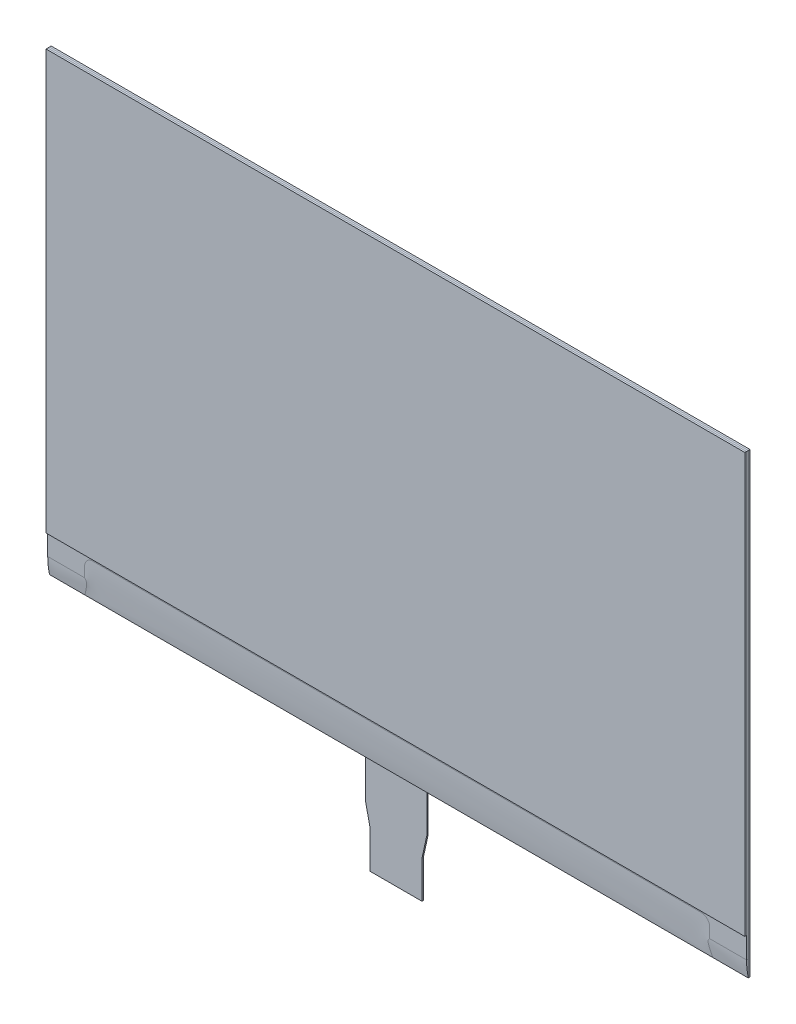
ISO-10303-21;
HEADER;
FILE_DESCRIPTION(('STEP AP214'),'2;1');
FILE_NAME('part.step','',(''),(''),'','','');
FILE_SCHEMA(('AUTOMOTIVE_DESIGN { 1 0 10303 214 1 1 1 1 }'));
ENDSEC;
DATA;
#1=APPLICATION_CONTEXT('core data for automotive mechanical design processes');
#2=APPLICATION_PROTOCOL_DEFINITION('international standard','automotive_design',2000,#1);
#3=PRODUCT_CONTEXT('',#1,'mechanical');
#4=PRODUCT('Part','Part','',(#3));
#5=PRODUCT_RELATED_PRODUCT_CATEGORY('part','',(#4));
#6=PRODUCT_DEFINITION_FORMATION('','',#4);
#7=PRODUCT_DEFINITION_CONTEXT('part definition',#1,'design');
#8=PRODUCT_DEFINITION('design','',#6,#7);
#9=PRODUCT_DEFINITION_SHAPE('','',#8);
#10=(LENGTH_UNIT() NAMED_UNIT(*) SI_UNIT(.MILLI.,.METRE.));
#11=(NAMED_UNIT(*) PLANE_ANGLE_UNIT() SI_UNIT($,.RADIAN.));
#12=(NAMED_UNIT(*) SI_UNIT($,.STERADIAN.) SOLID_ANGLE_UNIT());
#13=UNCERTAINTY_MEASURE_WITH_UNIT(LENGTH_MEASURE(1.E-05),#10,'distance_accuracy_value','');
#14=(GEOMETRIC_REPRESENTATION_CONTEXT(3) GLOBAL_UNCERTAINTY_ASSIGNED_CONTEXT((#13)) GLOBAL_UNIT_ASSIGNED_CONTEXT((#10,
#11,#12)) REPRESENTATION_CONTEXT('',''));
#15=CARTESIAN_POINT('',(0.,0.,0.));
#16=DIRECTION('',(0.,0.,1.));
#17=DIRECTION('',(1.,0.,0.));
#18=AXIS2_PLACEMENT_3D('',#15,#16,#17);
#19=CARTESIAN_POINT('',(-8.60000000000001,-55.7,0.));
#20=DIRECTION('',(0.,1.,0.));
#21=DIRECTION('',(1.,0.,0.));
#22=AXIS2_PLACEMENT_3D('',#19,#20,#21);
#23=PLANE('',#22);
#24=DIRECTION('',(0.,0.,-1.));
#25=VECTOR('',#24,1.);
#26=CARTESIAN_POINT('',(-8.60000000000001,-55.7,0.));
#27=LINE('',#26,#25);
#28=CARTESIAN_POINT('',(-8.60000000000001,-55.7,0.));
#29=VERTEX_POINT('',#28);
#30=CARTESIAN_POINT('',(-8.60000000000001,-55.7,-0.33));
#31=VERTEX_POINT('',#30);
#32=EDGE_CURVE('E13',#29,#31,#27,.T.);
#33=ORIENTED_EDGE('',*,*,#32,.F.);
#34=DIRECTION('',(1.,0.,0.));
#35=VECTOR('',#34,1.);
#36=CARTESIAN_POINT('',(-8.60000000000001,-55.7,0.));
#37=LINE('',#36,#35);
#38=CARTESIAN_POINT('',(6.39999999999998,-55.7,0.));
#39=VERTEX_POINT('',#38);
#40=EDGE_CURVE('E315',#29,#39,#37,.T.);
#41=ORIENTED_EDGE('',*,*,#40,.T.);
#42=DIRECTION('',(0.,0.,-1.));
#43=VECTOR('',#42,1.);
#44=CARTESIAN_POINT('',(6.39999999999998,-55.7,0.));
#45=LINE('',#44,#43);
#46=CARTESIAN_POINT('',(6.39999999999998,-55.7,-0.33));
#47=VERTEX_POINT('',#46);
#48=EDGE_CURVE('E210',#39,#47,#45,.T.);
#49=ORIENTED_EDGE('',*,*,#48,.T.);
#50=DIRECTION('',(-1.,0.,0.));
#51=VECTOR('',#50,1.);
#52=CARTESIAN_POINT('',(0.,-55.7,-0.33));
#53=LINE('',#52,#51);
#54=EDGE_CURVE('E307',#31,#47,#53,.F.);
#55=ORIENTED_EDGE('',*,*,#54,.F.);
#56=EDGE_LOOP('',(#33,#41,#49,#55));
#57=FACE_BOUND('',#56,.T.);
#58=ADVANCED_FACE('F198',(#57),#23,.T.);
#59=CARTESIAN_POINT('',(6.39999999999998,-55.7,0.));
#60=DIRECTION('',(1.,0.,0.));
#61=DIRECTION('',(0.,-1.,0.));
#62=AXIS2_PLACEMENT_3D('',#59,#60,#61);
#63=PLANE('',#62);
#64=DIRECTION('',(0.,0.,-1.));
#65=VECTOR('',#64,1.);
#66=CARTESIAN_POINT('',(6.39999999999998,-65.2,0.));
#67=LINE('',#66,#65);
#68=CARTESIAN_POINT('',(6.39999999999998,-65.2,0.));
#69=VERTEX_POINT('',#68);
#70=CARTESIAN_POINT('',(6.39999999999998,-65.2,-0.33));
#71=VERTEX_POINT('',#70);
#72=EDGE_CURVE('E350',#69,#71,#67,.T.);
#73=ORIENTED_EDGE('',*,*,#72,.T.);
#74=DIRECTION('',(0.,1.,0.));
#75=VECTOR('',#74,1.);
#76=CARTESIAN_POINT('',(6.39999999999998,0.,-0.33));
#77=LINE('',#76,#75);
#78=EDGE_CURVE('E257',#47,#71,#77,.F.);
#79=ORIENTED_EDGE('',*,*,#78,.F.);
#80=ORIENTED_EDGE('',*,*,#48,.F.);
#81=DIRECTION('',(0.,-1.,0.));
#82=VECTOR('',#81,1.);
#83=CARTESIAN_POINT('',(6.39999999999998,-55.7,0.));
#84=LINE('',#83,#82);
#85=EDGE_CURVE('E314',#39,#69,#84,.T.);
#86=ORIENTED_EDGE('',*,*,#85,.T.);
#87=EDGE_LOOP('',(#73,#79,#80,#86));
#88=FACE_BOUND('',#87,.T.);
#89=ADVANCED_FACE('F351',(#88),#63,.T.);
#90=CARTESIAN_POINT('',(6.39999999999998,-65.2,0.));
#91=DIRECTION('',(0.977015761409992,-0.213167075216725,0.));
#92=DIRECTION('',(-0.213167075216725,-0.977015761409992,0.));
#93=AXIS2_PLACEMENT_3D('',#90,#91,#92);
#94=PLANE('',#93);
#95=ORIENTED_EDGE('',*,*,#72,.F.);
#96=DIRECTION('',(-0.213167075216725,-0.977015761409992,0.));
#97=VECTOR('',#96,1.);
#98=CARTESIAN_POINT('',(6.39999999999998,-65.2,0.));
#99=LINE('',#98,#97);
#100=CARTESIAN_POINT('',(5.19999999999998,-70.7,0.));
#101=VERTEX_POINT('',#100);
#102=EDGE_CURVE('E319',#69,#101,#99,.T.);
#103=ORIENTED_EDGE('',*,*,#102,.T.);
#104=DIRECTION('',(0.,0.,-1.));
#105=VECTOR('',#104,1.);
#106=CARTESIAN_POINT('',(5.19999999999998,-70.7,0.));
#107=LINE('',#106,#105);
#108=CARTESIAN_POINT('',(5.19999999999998,-70.7,-0.33));
#109=VERTEX_POINT('',#108);
#110=EDGE_CURVE('E345',#101,#109,#107,.T.);
#111=ORIENTED_EDGE('',*,*,#110,.T.);
#112=DIRECTION('',(-0.213167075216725,-0.977015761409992,0.));
#113=VECTOR('',#112,1.);
#114=CARTESIAN_POINT('',(6.39999999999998,-65.2,-0.33));
#115=LINE('',#114,#113);
#116=EDGE_CURVE('E302',#71,#109,#115,.T.);
#117=ORIENTED_EDGE('',*,*,#116,.F.);
#118=EDGE_LOOP('',(#95,#103,#111,#117));
#119=FACE_BOUND('',#118,.T.);
#120=ADVANCED_FACE('F357',(#119),#94,.T.);
#121=CARTESIAN_POINT('',(5.19999999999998,-70.7,0.));
#122=DIRECTION('',(1.,0.,0.));
#123=DIRECTION('',(0.,-1.,0.));
#124=AXIS2_PLACEMENT_3D('',#121,#122,#123);
#125=PLANE('',#124);
#126=ORIENTED_EDGE('',*,*,#110,.F.);
#127=DIRECTION('',(0.,-1.,0.));
#128=VECTOR('',#127,1.);
#129=CARTESIAN_POINT('',(5.19999999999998,-70.7,0.));
#130=LINE('',#129,#128);
#131=CARTESIAN_POINT('',(5.19999999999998,-79.7,0.));
#132=VERTEX_POINT('',#131);
#133=EDGE_CURVE('E324',#101,#132,#130,.T.);
#134=ORIENTED_EDGE('',*,*,#133,.T.);
#135=DIRECTION('',(0.,0.,-1.));
#136=VECTOR('',#135,1.);
#137=CARTESIAN_POINT('',(5.19999999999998,-79.7,0.));
#138=LINE('',#137,#136);
#139=CARTESIAN_POINT('',(5.19999999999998,-79.7,-0.33));
#140=VERTEX_POINT('',#139);
#141=EDGE_CURVE('E343',#132,#140,#138,.T.);
#142=ORIENTED_EDGE('',*,*,#141,.T.);
#143=DIRECTION('',(0.,1.,0.));
#144=VECTOR('',#143,1.);
#145=CARTESIAN_POINT('',(5.19999999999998,0.,-0.33));
#146=LINE('',#145,#144);
#147=EDGE_CURVE('E305',#109,#140,#146,.F.);
#148=ORIENTED_EDGE('',*,*,#147,.F.);
#149=EDGE_LOOP('',(#126,#134,#142,#148));
#150=FACE_BOUND('',#149,.T.);
#151=ADVANCED_FACE('F359',(#150),#125,.T.);
#152=CARTESIAN_POINT('',(5.19999999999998,-79.7,0.));
#153=DIRECTION('',(0.,-1.,0.));
#154=DIRECTION('',(-1.,0.,0.));
#155=AXIS2_PLACEMENT_3D('',#152,#153,#154);
#156=PLANE('',#155);
#157=ORIENTED_EDGE('',*,*,#141,.F.);
#158=DIRECTION('',(-1.,0.,0.));
#159=VECTOR('',#158,1.);
#160=CARTESIAN_POINT('',(5.19999999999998,-79.7,0.));
#161=LINE('',#160,#159);
#162=CARTESIAN_POINT('',(-7.40000000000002,-79.7,0.));
#163=VERTEX_POINT('',#162);
#164=EDGE_CURVE('E327',#132,#163,#161,.T.);
#165=ORIENTED_EDGE('',*,*,#164,.T.);
#166=DIRECTION('',(0.,0.,-1.));
#167=VECTOR('',#166,1.);
#168=CARTESIAN_POINT('',(-7.40000000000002,-79.7,0.));
#169=LINE('',#168,#167);
#170=CARTESIAN_POINT('',(-7.40000000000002,-79.7,-0.33));
#171=VERTEX_POINT('',#170);
#172=EDGE_CURVE('E283',#163,#171,#169,.T.);
#173=ORIENTED_EDGE('',*,*,#172,.T.);
#174=DIRECTION('',(-1.,0.,0.));
#175=VECTOR('',#174,1.);
#176=CARTESIAN_POINT('',(0.,-79.7,-0.33));
#177=LINE('',#176,#175);
#178=EDGE_CURVE('E289',#140,#171,#177,.T.);
#179=ORIENTED_EDGE('',*,*,#178,.F.);
#180=EDGE_LOOP('',(#157,#165,#173,#179));
#181=FACE_BOUND('',#180,.T.);
#182=ADVANCED_FACE('F364',(#181),#156,.T.);
#183=CARTESIAN_POINT('',(-7.40000000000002,-70.7,0.));
#184=DIRECTION('',(-1.,0.,0.));
#185=DIRECTION('',(0.,1.,0.));
#186=AXIS2_PLACEMENT_3D('',#183,#184,#185);
#187=PLANE('',#186);
#188=ORIENTED_EDGE('',*,*,#172,.F.);
#189=DIRECTION('',(0.,1.,0.));
#190=VECTOR('',#189,1.);
#191=CARTESIAN_POINT('',(-7.40000000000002,-70.7,0.));
#192=LINE('',#191,#190);
#193=CARTESIAN_POINT('',(-7.40000000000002,-70.7,0.));
#194=VERTEX_POINT('',#193);
#195=EDGE_CURVE('E277',#163,#194,#192,.T.);
#196=ORIENTED_EDGE('',*,*,#195,.T.);
#197=DIRECTION('',(0.,0.,-1.));
#198=VECTOR('',#197,1.);
#199=CARTESIAN_POINT('',(-7.40000000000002,-70.7,0.));
#200=LINE('',#199,#198);
#201=CARTESIAN_POINT('',(-7.40000000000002,-70.7,-0.33));
#202=VERTEX_POINT('',#201);
#203=EDGE_CURVE('E271',#194,#202,#200,.T.);
#204=ORIENTED_EDGE('',*,*,#203,.T.);
#205=DIRECTION('',(0.,1.,0.));
#206=VECTOR('',#205,1.);
#207=CARTESIAN_POINT('',(-7.40000000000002,0.,-0.33));
#208=LINE('',#207,#206);
#209=EDGE_CURVE('E278',#171,#202,#208,.T.);
#210=ORIENTED_EDGE('',*,*,#209,.F.);
#211=EDGE_LOOP('',(#188,#196,#204,#210));
#212=FACE_BOUND('',#211,.T.);
#213=ADVANCED_FACE('F273',(#212),#187,.T.);
#214=CARTESIAN_POINT('',(-8.60000000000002,-65.2,0.));
#215=DIRECTION('',(-0.977015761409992,-0.213167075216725,0.));
#216=DIRECTION('',(-0.213167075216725,0.977015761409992,0.));
#217=AXIS2_PLACEMENT_3D('',#214,#215,#216);
#218=PLANE('',#217);
#219=ORIENTED_EDGE('',*,*,#203,.F.);
#220=DIRECTION('',(-0.213167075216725,0.977015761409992,0.));
#221=VECTOR('',#220,1.);
#222=CARTESIAN_POINT('',(-8.60000000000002,-65.2,0.));
#223=LINE('',#222,#221);
#224=CARTESIAN_POINT('',(-8.60000000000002,-65.2,0.));
#225=VERTEX_POINT('',#224);
#226=EDGE_CURVE('E335',#194,#225,#223,.T.);
#227=ORIENTED_EDGE('',*,*,#226,.T.);
#228=DIRECTION('',(0.,0.,-1.));
#229=VECTOR('',#228,1.);
#230=CARTESIAN_POINT('',(-8.60000000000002,-65.2,0.));
#231=LINE('',#230,#229);
#232=CARTESIAN_POINT('',(-8.60000000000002,-65.2,-0.33));
#233=VERTEX_POINT('',#232);
#234=EDGE_CURVE('E242',#225,#233,#231,.T.);
#235=ORIENTED_EDGE('',*,*,#234,.T.);
#236=DIRECTION('',(-0.213167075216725,0.977015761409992,0.));
#237=VECTOR('',#236,1.);
#238=CARTESIAN_POINT('',(-8.60000000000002,-65.2,-0.33));
#239=LINE('',#238,#237);
#240=EDGE_CURVE('E290',#202,#233,#239,.T.);
#241=ORIENTED_EDGE('',*,*,#240,.F.);
#242=EDGE_LOOP('',(#219,#227,#235,#241));
#243=FACE_BOUND('',#242,.T.);
#244=ADVANCED_FACE('F291',(#243),#218,.T.);
#245=CARTESIAN_POINT('',(-8.60000000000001,-55.7,0.));
#246=DIRECTION('',(-1.,0.,0.));
#247=DIRECTION('',(0.,1.,0.));
#248=AXIS2_PLACEMENT_3D('',#245,#246,#247);
#249=PLANE('',#248);
#250=DIRECTION('',(0.,1.,0.));
#251=VECTOR('',#250,1.);
#252=CARTESIAN_POINT('',(-8.60000000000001,-55.7,0.));
#253=LINE('',#252,#251);
#254=EDGE_CURVE('E250',#225,#29,#253,.T.);
#255=ORIENTED_EDGE('',*,*,#254,.T.);
#256=ORIENTED_EDGE('',*,*,#32,.T.);
#257=DIRECTION('',(0.,1.,0.));
#258=VECTOR('',#257,1.);
#259=CARTESIAN_POINT('',(-8.60000000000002,0.,-0.33));
#260=LINE('',#259,#258);
#261=EDGE_CURVE('E211',#233,#31,#260,.T.);
#262=ORIENTED_EDGE('',*,*,#261,.F.);
#263=ORIENTED_EDGE('',*,*,#234,.F.);
#264=EDGE_LOOP('',(#255,#256,#262,#263));
#265=FACE_BOUND('',#264,.T.);
#266=ADVANCED_FACE('F368',(#265),#249,.T.);
#267=CARTESIAN_POINT('',(0.,0.,-0.33));
#268=DIRECTION('',(0.,0.,-1.));
#269=DIRECTION('',(-1.,0.,0.));
#270=AXIS2_PLACEMENT_3D('',#267,#268,#269);
#271=PLANE('',#270);
#272=ORIENTED_EDGE('',*,*,#78,.T.);
#273=ORIENTED_EDGE('',*,*,#116,.T.);
#274=ORIENTED_EDGE('',*,*,#147,.T.);
#275=ORIENTED_EDGE('',*,*,#178,.T.);
#276=ORIENTED_EDGE('',*,*,#209,.T.);
#277=ORIENTED_EDGE('',*,*,#240,.T.);
#278=ORIENTED_EDGE('',*,*,#261,.T.);
#279=ORIENTED_EDGE('',*,*,#54,.T.);
#280=EDGE_LOOP('',(#272,#273,#274,#275,#276,#277,#278,#279));
#281=FACE_BOUND('',#280,.T.);
#282=ADVANCED_FACE('F288',(#281),#271,.T.);
#283=CARTESIAN_POINT('',(0.,0.,0.));
#284=DIRECTION('',(0.,0.,-1.));
#285=DIRECTION('',(-1.,0.,0.));
#286=AXIS2_PLACEMENT_3D('',#283,#284,#285);
#287=PLANE('',#286);
#288=ORIENTED_EDGE('',*,*,#40,.F.);
#289=ORIENTED_EDGE('',*,*,#254,.F.);
#290=ORIENTED_EDGE('',*,*,#226,.F.);
#291=ORIENTED_EDGE('',*,*,#195,.F.);
#292=ORIENTED_EDGE('',*,*,#164,.F.);
#293=ORIENTED_EDGE('',*,*,#133,.F.);
#294=ORIENTED_EDGE('',*,*,#102,.F.);
#295=ORIENTED_EDGE('',*,*,#85,.F.);
#296=EDGE_LOOP('',(#288,#289,#290,#291,#292,#293,#294,#295));
#297=FACE_BOUND('',#296,.T.);
#298=ADVANCED_FACE('F370',(#297),#287,.F.);
#299=CLOSED_SHELL('',(#58,#89,#120,#151,#182,#213,#244,#266,#282,#298));
#300=MANIFOLD_SOLID_BREP('B2',#299);
#301=CARTESIAN_POINT('',(-85.2,55.71,0.84));
#302=DIRECTION('',(0.,0.,-1.));
#303=DIRECTION('',(-1.,0.,0.));
#304=AXIS2_PLACEMENT_3D('',#301,#302,#303);
#305=PLANE('',#304);
#306=DIRECTION('',(1.,0.,0.));
#307=VECTOR('',#306,1.);
#308=CARTESIAN_POINT('',(-85.2,-46.51,0.84));
#309=LINE('',#308,#307);
#310=CARTESIAN_POINT('',(-85.2,-46.51,0.84));
#311=VERTEX_POINT('',#310);
#312=CARTESIAN_POINT('',(85.2,-46.51,0.84));
#313=VERTEX_POINT('',#312);
#314=EDGE_CURVE('E197',#311,#313,#309,.T.);
#315=ORIENTED_EDGE('',*,*,#314,.F.);
#316=DIRECTION('',(0.,-1.,0.));
#317=VECTOR('',#316,1.);
#318=CARTESIAN_POINT('',(-85.2,-55.7,0.84));
#319=LINE('',#318,#317);
#320=CARTESIAN_POINT('',(-85.2,55.7,0.84));
#321=VERTEX_POINT('',#320);
#322=EDGE_CURVE('E563',#321,#311,#319,.T.);
#323=ORIENTED_EDGE('',*,*,#322,.F.);
#324=DIRECTION('',(-1.,0.,0.));
#325=VECTOR('',#324,1.);
#326=CARTESIAN_POINT('',(-85.2,55.7,0.84));
#327=LINE('',#326,#325);
#328=CARTESIAN_POINT('',(85.2,55.7,0.84));
#329=VERTEX_POINT('',#328);
#330=EDGE_CURVE('E533',#329,#321,#327,.T.);
#331=ORIENTED_EDGE('',*,*,#330,.F.);
#332=DIRECTION('',(0.,1.,0.));
#333=VECTOR('',#332,1.);
#334=CARTESIAN_POINT('',(85.2,-55.7,0.84));
#335=LINE('',#334,#333);
#336=EDGE_CURVE('E566',#313,#329,#335,.T.);
#337=ORIENTED_EDGE('',*,*,#336,.F.);
#338=EDGE_LOOP('',(#315,#323,#331,#337));
#339=FACE_BOUND('',#338,.T.);
#340=ADVANCED_FACE('F491',(#339),#305,.T.);
#341=CARTESIAN_POINT('',(-85.2,-55.7,0.42));
#342=DIRECTION('',(1.,0.,0.));
#343=DIRECTION('',(0.,0.,-1.));
#344=AXIS2_PLACEMENT_3D('',#341,#342,#343);
#345=PLANE('',#344);
#346=DIRECTION('',(0.,0.,-1.));
#347=VECTOR('',#346,1.);
#348=CARTESIAN_POINT('',(-85.2,55.7,0.42));
#349=LINE('',#348,#347);
#350=CARTESIAN_POINT('',(-85.2,55.7,1.26));
#351=VERTEX_POINT('',#350);
#352=EDGE_CURVE('E500',#351,#321,#349,.T.);
#353=ORIENTED_EDGE('',*,*,#352,.T.);
#354=ORIENTED_EDGE('',*,*,#322,.T.);
#355=DIRECTION('',(0.,0.,-1.));
#356=VECTOR('',#355,1.);
#357=CARTESIAN_POINT('',(-85.2,-46.51,1.26));
#358=LINE('',#357,#356);
#359=CARTESIAN_POINT('',(-85.2,-46.51,1.26));
#360=VERTEX_POINT('',#359);
#361=EDGE_CURVE('E536',#360,#311,#358,.T.);
#362=ORIENTED_EDGE('',*,*,#361,.F.);
#363=DIRECTION('',(0.,-1.,0.));
#364=VECTOR('',#363,1.);
#365=CARTESIAN_POINT('',(-85.2,-46.51,1.26));
#366=LINE('',#365,#364);
#367=EDGE_CURVE('E544',#351,#360,#366,.T.);
#368=ORIENTED_EDGE('',*,*,#367,.F.);
#369=EDGE_LOOP('',(#353,#354,#362,#368));
#370=FACE_BOUND('',#369,.T.);
#371=ADVANCED_FACE('F547',(#370),#345,.F.);
#372=CARTESIAN_POINT('',(0.,0.,1.26));
#373=DIRECTION('',(0.,0.,-1.));
#374=DIRECTION('',(-1.,0.,0.));
#375=AXIS2_PLACEMENT_3D('',#372,#373,#374);
#376=PLANE('',#375);
#377=DIRECTION('',(0.,1.,0.));
#378=VECTOR('',#377,1.);
#379=CARTESIAN_POINT('',(85.2,-46.51,1.26));
#380=LINE('',#379,#378);
#381=CARTESIAN_POINT('',(85.2,-46.51,1.26));
#382=VERTEX_POINT('',#381);
#383=CARTESIAN_POINT('',(85.2,55.7,1.26));
#384=VERTEX_POINT('',#383);
#385=EDGE_CURVE('E502',#382,#384,#380,.T.);
#386=ORIENTED_EDGE('',*,*,#385,.T.);
#387=DIRECTION('',(-1.,0.,0.));
#388=VECTOR('',#387,1.);
#389=CARTESIAN_POINT('',(-85.2,55.7,1.26));
#390=LINE('',#389,#388);
#391=EDGE_CURVE('E532',#384,#351,#390,.T.);
#392=ORIENTED_EDGE('',*,*,#391,.T.);
#393=ORIENTED_EDGE('',*,*,#367,.T.);
#394=DIRECTION('',(1.,0.,0.));
#395=VECTOR('',#394,1.);
#396=CARTESIAN_POINT('',(-85.2,-46.51,1.26));
#397=LINE('',#396,#395);
#398=EDGE_CURVE('E552',#360,#382,#397,.T.);
#399=ORIENTED_EDGE('',*,*,#398,.T.);
#400=EDGE_LOOP('',(#386,#392,#393,#399));
#401=FACE_BOUND('',#400,.T.);
#402=ADVANCED_FACE('F543',(#401),#376,.F.);
#403=CARTESIAN_POINT('',(-85.2,55.7,0.42));
#404=DIRECTION('',(0.,-1.,0.));
#405=DIRECTION('',(0.,0.,-1.));
#406=AXIS2_PLACEMENT_3D('',#403,#404,#405);
#407=PLANE('',#406);
#408=DIRECTION('',(0.,0.,-1.));
#409=VECTOR('',#408,1.);
#410=CARTESIAN_POINT('',(85.2,55.7,0.42));
#411=LINE('',#410,#409);
#412=EDGE_CURVE('E542',#384,#329,#411,.T.);
#413=ORIENTED_EDGE('',*,*,#412,.T.);
#414=ORIENTED_EDGE('',*,*,#330,.T.);
#415=ORIENTED_EDGE('',*,*,#352,.F.);
#416=ORIENTED_EDGE('',*,*,#391,.F.);
#417=EDGE_LOOP('',(#413,#414,#415,#416));
#418=FACE_BOUND('',#417,.T.);
#419=ADVANCED_FACE('F529',(#418),#407,.F.);
#420=CARTESIAN_POINT('',(-85.2,-46.51,1.26));
#421=DIRECTION('',(0.,1.,0.));
#422=DIRECTION('',(0.,0.,1.));
#423=AXIS2_PLACEMENT_3D('',#420,#421,#422);
#424=PLANE('',#423);
#425=ORIENTED_EDGE('',*,*,#314,.T.);
#426=DIRECTION('',(0.,0.,-1.));
#427=VECTOR('',#426,1.);
#428=CARTESIAN_POINT('',(85.2,-46.51,1.26));
#429=LINE('',#428,#427);
#430=EDGE_CURVE('E560',#382,#313,#429,.T.);
#431=ORIENTED_EDGE('',*,*,#430,.F.);
#432=ORIENTED_EDGE('',*,*,#398,.F.);
#433=ORIENTED_EDGE('',*,*,#361,.T.);
#434=EDGE_LOOP('',(#425,#431,#432,#433));
#435=FACE_BOUND('',#434,.T.);
#436=ADVANCED_FACE('F580',(#435),#424,.F.);
#437=CARTESIAN_POINT('',(85.2,-55.7,0.42));
#438=DIRECTION('',(-1.,0.,0.));
#439=DIRECTION('',(0.,-1.,0.));
#440=AXIS2_PLACEMENT_3D('',#437,#438,#439);
#441=PLANE('',#440);
#442=ORIENTED_EDGE('',*,*,#430,.T.);
#443=ORIENTED_EDGE('',*,*,#336,.T.);
#444=ORIENTED_EDGE('',*,*,#412,.F.);
#445=ORIENTED_EDGE('',*,*,#385,.F.);
#446=EDGE_LOOP('',(#442,#443,#444,#445));
#447=FACE_BOUND('',#446,.T.);
#448=ADVANCED_FACE('F492',(#447),#441,.F.);
#449=CLOSED_SHELL('',(#340,#371,#402,#419,#436,#448));
#450=MANIFOLD_SOLID_BREP('B7',#449);
#451=CARTESIAN_POINT('',(0.,0.,0.));
#452=DIRECTION('',(0.,0.,-1.));
#453=DIRECTION('',(-1.,0.,0.));
#454=AXIS2_PLACEMENT_3D('',#451,#452,#453);
#455=PLANE('',#454);
#456=DIRECTION('',(0.,1.,0.));
#457=VECTOR('',#456,1.);
#458=CARTESIAN_POINT('',(85.2,-55.7,0.));
#459=LINE('',#458,#457);
#460=CARTESIAN_POINT('',(85.2,-55.7,0.));
#461=VERTEX_POINT('',#460);
#462=CARTESIAN_POINT('',(85.2,55.7,0.));
#463=VERTEX_POINT('',#462);
#464=EDGE_CURVE('E815',#461,#463,#459,.T.);
#465=ORIENTED_EDGE('',*,*,#464,.F.);
#466=DIRECTION('',(1.,0.,0.));
#467=VECTOR('',#466,1.);
#468=CARTESIAN_POINT('',(-85.2,-55.7,0.));
#469=LINE('',#468,#467);
#470=CARTESIAN_POINT('',(-85.2,-55.7,0.));
#471=VERTEX_POINT('',#470);
#472=EDGE_CURVE('E835',#471,#461,#469,.T.);
#473=ORIENTED_EDGE('',*,*,#472,.F.);
#474=DIRECTION('',(0.,-1.,0.));
#475=VECTOR('',#474,1.);
#476=CARTESIAN_POINT('',(-85.2,-55.7,0.));
#477=LINE('',#476,#475);
#478=CARTESIAN_POINT('',(-85.2,55.7,0.));
#479=VERTEX_POINT('',#478);
#480=EDGE_CURVE('E814',#479,#471,#477,.T.);
#481=ORIENTED_EDGE('',*,*,#480,.F.);
#482=DIRECTION('',(-1.,0.,0.));
#483=VECTOR('',#482,1.);
#484=CARTESIAN_POINT('',(-85.2,55.7,0.));
#485=LINE('',#484,#483);
#486=EDGE_CURVE('E796',#463,#479,#485,.T.);
#487=ORIENTED_EDGE('',*,*,#486,.F.);
#488=EDGE_LOOP('',(#465,#473,#481,#487));
#489=FACE_BOUND('',#488,.T.);
#490=ADVANCED_FACE('F703',(#489),#455,.T.);
#491=CARTESIAN_POINT('',(-76.2,-51.68,0.84));
#492=CARTESIAN_POINT('',(-75.8112930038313,-52.0687069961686,0.84));
#493=CARTESIAN_POINT('',(-75.4225860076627,-52.4574139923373,0.84));
#494=CARTESIAN_POINT('',(-75.9466431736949,-53.6767069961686,0.672));
#495=CARTESIAN_POINT('',(-76.2425092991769,-54.6883534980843,0.546));
#496=CARTESIAN_POINT('',(-76.5383754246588,-55.7,0.42));
#497=CARTESIAN_POINT('',(-78.,-51.68,0.84));
#498=CARTESIAN_POINT('',(-77.6890343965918,-52.1435997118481,0.84));
#499=CARTESIAN_POINT('',(-77.3780687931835,-52.6071994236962,0.84));
#500=CARTESIAN_POINT('',(-77.7973145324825,-53.7515997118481,0.672));
#501=CARTESIAN_POINT('',(-78.0340074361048,-54.7257998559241,0.546));
#502=CARTESIAN_POINT('',(-78.2707003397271,-55.7,0.42));
#503=CARTESIAN_POINT('',(-79.7999999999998,-51.6799999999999,0.839999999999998));
#504=CARTESIAN_POINT('',(-79.5667757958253,-52.2543918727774,0.839999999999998));
#505=CARTESIAN_POINT('',(-79.3335515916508,-52.828783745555,0.839999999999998));
#506=CARTESIAN_POINT('',(-79.6479858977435,-53.8623918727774,0.671999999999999));
#507=CARTESIAN_POINT('',(-79.8255055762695,-54.7811959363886,0.545999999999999));
#508=CARTESIAN_POINT('',(-80.0030252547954,-55.6999999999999,0.419999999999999));
#509=CARTESIAN_POINT('',(-81.6,-51.68,0.839999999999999));
#510=CARTESIAN_POINT('',(-81.4445171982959,-52.369310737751,0.839999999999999));
#511=CARTESIAN_POINT('',(-81.2890343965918,-53.058621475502,0.839999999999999));
#512=CARTESIAN_POINT('',(-81.4986572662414,-53.977310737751,0.671999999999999));
#513=CARTESIAN_POINT('',(-81.6170037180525,-54.8386553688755,0.545999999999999));
#514=CARTESIAN_POINT('',(-81.7353501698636,-55.7,0.42));
#515=CARTESIAN_POINT('',(-83.4,-51.68,0.84));
#516=CARTESIAN_POINT('',(-83.3222586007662,-52.4565835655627,0.84));
#517=CARTESIAN_POINT('',(-83.2445172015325,-53.2331671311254,0.84));
#518=CARTESIAN_POINT('',(-83.349328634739,-54.0645835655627,0.672));
#519=CARTESIAN_POINT('',(-83.4085018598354,-54.8822917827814,0.546));
#520=CARTESIAN_POINT('',(-83.4676750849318,-55.7,0.42));
#521=CARTESIAN_POINT('',(-85.2,-51.68,0.84));
#522=CARTESIAN_POINT('',(-85.2,-52.4844376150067,0.84));
#523=CARTESIAN_POINT('',(-85.2,-53.2888752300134,0.84));
#524=CARTESIAN_POINT('',(-85.2,-54.0924376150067,0.672));
#525=CARTESIAN_POINT('',(-85.2,-54.8962188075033,0.546));
#526=CARTESIAN_POINT('',(-85.2,-55.7,0.42));
#527=B_SPLINE_SURFACE_WITH_KNOTS('',5,5,((#491,#492,#493,#494,#495,#496),(#497,#498,#499,#500,
#501,#502),(#503,#504,#505,#506,#507,#508),(#509,#510,#511,#512,#513,#514),(#515,#516,#517,#518,
#519,#520),(#521,#522,#523,#524,#525,#526)),.UNSPECIFIED.,.F.,.F.,.F.,(6,6),(6,6),(0.,1.),(0.,
1.),.UNSPECIFIED.);
#528=CARTESIAN_POINT('',(-85.2,-51.68,0.84));
#529=CARTESIAN_POINT('',(-85.2,-52.4844376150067,0.84));
#530=CARTESIAN_POINT('',(-85.2,-53.2888752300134,0.84));
#531=CARTESIAN_POINT('',(-85.2,-54.0924376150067,0.672));
#532=CARTESIAN_POINT('',(-85.2,-54.8962188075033,0.546));
#533=CARTESIAN_POINT('',(-85.2,-55.7,0.42));
#534=B_SPLINE_CURVE_WITH_KNOTS('',5,(#528,#529,#530,#531,#532,#533),.UNSPECIFIED.,.F.,.F.,(6,6),
(0.,1.),.UNSPECIFIED.);
#535=CARTESIAN_POINT('',(-85.2,-51.68,0.84));
#536=VERTEX_POINT('',#535);
#537=CARTESIAN_POINT('',(-85.2,-55.7,0.42));
#538=VERTEX_POINT('',#537);
#539=EDGE_CURVE('E1037',#536,#538,#534,.T.);
#540=CARTESIAN_POINT('',(-85.2,-55.7,0.42));
#541=CARTESIAN_POINT('',(-83.4676750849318,-55.7,0.42));
#542=CARTESIAN_POINT('',(-81.7353501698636,-55.7,0.42));
#543=CARTESIAN_POINT('',(-80.0030252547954,-55.6999999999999,0.419999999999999));
#544=CARTESIAN_POINT('',(-78.2707003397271,-55.7,0.42));
#545=CARTESIAN_POINT('',(-76.5383754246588,-55.7,0.42));
#546=B_SPLINE_CURVE_WITH_KNOTS('',5,(#540,#541,#542,#543,#544,#545),.UNSPECIFIED.,.F.,.F.,(6,6),
(0.,1.),.UNSPECIFIED.);
#547=CARTESIAN_POINT('',(-76.5383754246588,-55.7,0.42));
#548=VERTEX_POINT('',#547);
#549=EDGE_CURVE('E933',#538,#548,#546,.T.);
#550=CARTESIAN_POINT('',(-76.2,-51.68,0.84));
#551=CARTESIAN_POINT('',(-75.8112930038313,-52.0687069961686,0.839999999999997));
#552=CARTESIAN_POINT('',(-75.4225860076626,-52.4574139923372,0.839999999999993));
#553=CARTESIAN_POINT('',(-75.9466431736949,-53.6767069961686,0.671999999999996));
#554=CARTESIAN_POINT('',(-76.2425092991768,-54.6883534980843,0.545999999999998));
#555=CARTESIAN_POINT('',(-76.5383754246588,-55.7,0.42));
#556=B_SPLINE_CURVE_WITH_KNOTS('',5,(#550,#551,#552,#553,#554,#555),.UNSPECIFIED.,.F.,.F.,(6,6),
(0.,1.),.UNSPECIFIED.);
#557=CARTESIAN_POINT('',(-76.2,-51.68,0.84));
#558=VERTEX_POINT('',#557);
#559=EDGE_CURVE('E713',#558,#548,#556,.T.);
#560=CARTESIAN_POINT('',(-76.2,-51.68,0.84));
#561=CARTESIAN_POINT('',(-78.,-51.68,0.84));
#562=CARTESIAN_POINT('',(-79.7999999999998,-51.6799999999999,0.839999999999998));
#563=CARTESIAN_POINT('',(-81.6,-51.68,0.839999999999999));
#564=CARTESIAN_POINT('',(-83.4,-51.68,0.84));
#565=CARTESIAN_POINT('',(-85.2,-51.68,0.84));
#566=B_SPLINE_CURVE_WITH_KNOTS('',5,(#560,#561,#562,#563,#564,#565),.UNSPECIFIED.,.F.,.F.,(6,6),
(0.,1.),.UNSPECIFIED.);
#567=EDGE_CURVE('E1136',#536,#558,#566,.F.);
#568=ORIENTED_EDGE('',*,*,#539,.T.);
#569=ORIENTED_EDGE('',*,*,#549,.T.);
#570=ORIENTED_EDGE('',*,*,#559,.F.);
#571=ORIENTED_EDGE('',*,*,#567,.F.);
#572=EDGE_LOOP('',(#568,#569,#570,#571));
#573=FACE_BOUND('',#572,.T.);
#574=ADVANCED_FACE('F707',(#573),#527,.T.);
#575=CARTESIAN_POINT('',(-85.2,-55.7,0.42));
#576=DIRECTION('',(1.,0.,0.));
#577=DIRECTION('',(0.,0.,-1.));
#578=AXIS2_PLACEMENT_3D('',#575,#576,#577);
#579=PLANE('',#578);
#580=DIRECTION('',(0.,0.,1.));
#581=VECTOR('',#580,1.);
#582=CARTESIAN_POINT('',(-85.2,-51.6799999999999,0.42));
#583=LINE('',#582,#581);
#584=CARTESIAN_POINT('',(-85.2,-51.6799999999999,0.42));
#585=VERTEX_POINT('',#584);
#586=EDGE_CURVE('E1074',#585,#536,#583,.T.);
#587=ORIENTED_EDGE('',*,*,#586,.F.);
#588=DIRECTION('',(0.,-1.,0.));
#589=VECTOR('',#588,1.);
#590=CARTESIAN_POINT('',(-85.2,-55.7,0.42));
#591=LINE('',#590,#589);
#592=EDGE_CURVE('E1061',#585,#538,#591,.T.);
#593=ORIENTED_EDGE('',*,*,#592,.T.);
#594=ORIENTED_EDGE('',*,*,#539,.F.);
#595=EDGE_LOOP('',(#587,#593,#594));
#596=FACE_BOUND('',#595,.T.);
#597=ADVANCED_FACE('F955',(#596),#579,.F.);
#598=CARTESIAN_POINT('',(-85.2,55.7,0.42));
#599=VERTEX_POINT('',#598);
#600=EDGE_CURVE('E1060',#599,#585,#591,.T.);
#601=ORIENTED_EDGE('',*,*,#600,.F.);
#602=DIRECTION('',(0.,0.,-1.));
#603=VECTOR('',#602,1.);
#604=CARTESIAN_POINT('',(-85.2,55.7,0.42));
#605=LINE('',#604,#603);
#606=EDGE_CURVE('E837',#599,#479,#605,.T.);
#607=ORIENTED_EDGE('',*,*,#606,.T.);
#608=ORIENTED_EDGE('',*,*,#480,.T.);
#609=DIRECTION('',(0.,0.,-1.));
#610=VECTOR('',#609,1.);
#611=CARTESIAN_POINT('',(-85.2,-55.7,0.42));
#612=LINE('',#611,#610);
#613=EDGE_CURVE('E839',#538,#471,#612,.T.);
#614=ORIENTED_EDGE('',*,*,#613,.F.);
#615=ORIENTED_EDGE('',*,*,#592,.F.);
#616=EDGE_LOOP('',(#601,#607,#608,#614,#615));
#617=FACE_BOUND('',#616,.T.);
#618=ADVANCED_FACE('F1226',(#617),#579,.F.);
#619=ORIENTED_EDGE('',*,*,#600,.T.);
#620=ORIENTED_EDGE('',*,*,#586,.T.);
#621=DIRECTION('',(0.,-1.,0.));
#622=VECTOR('',#621,1.);
#623=CARTESIAN_POINT('',(-85.2,0.,0.84));
#624=LINE('',#623,#622);
#625=CARTESIAN_POINT('',(-85.2,55.7,0.84));
#626=VERTEX_POINT('',#625);
#627=EDGE_CURVE('E727',#626,#536,#624,.T.);
#628=ORIENTED_EDGE('',*,*,#627,.F.);
#629=EDGE_CURVE('E807',#626,#599,#605,.T.);
#630=ORIENTED_EDGE('',*,*,#629,.T.);
#631=EDGE_LOOP('',(#619,#620,#628,#630));
#632=FACE_BOUND('',#631,.T.);
#633=ADVANCED_FACE('F1229',(#632),#579,.F.);
#634=CARTESIAN_POINT('',(-85.2,55.7,0.42));
#635=DIRECTION('',(0.,-1.,0.));
#636=DIRECTION('',(0.,0.,-1.));
#637=AXIS2_PLACEMENT_3D('',#634,#635,#636);
#638=PLANE('',#637);
#639=DIRECTION('',(-1.,0.,0.));
#640=VECTOR('',#639,1.);
#641=CARTESIAN_POINT('',(-85.2,55.7,0.42));
#642=LINE('',#641,#640);
#643=CARTESIAN_POINT('',(85.2,55.7,0.42));
#644=VERTEX_POINT('',#643);
#645=EDGE_CURVE('E805',#644,#599,#642,.T.);
#646=ORIENTED_EDGE('',*,*,#645,.F.);
#647=DIRECTION('',(0.,0.,-1.));
#648=VECTOR('',#647,1.);
#649=CARTESIAN_POINT('',(85.2,55.7,0.42));
#650=LINE('',#649,#648);
#651=EDGE_CURVE('E798',#644,#463,#650,.T.);
#652=ORIENTED_EDGE('',*,*,#651,.T.);
#653=ORIENTED_EDGE('',*,*,#486,.T.);
#654=ORIENTED_EDGE('',*,*,#606,.F.);
#655=EDGE_LOOP('',(#646,#652,#653,#654));
#656=FACE_BOUND('',#655,.T.);
#657=ADVANCED_FACE('F797',(#656),#638,.F.);
#658=CARTESIAN_POINT('',(85.2,55.7,0.84));
#659=VERTEX_POINT('',#658);
#660=EDGE_CURVE('E806',#659,#644,#650,.T.);
#661=ORIENTED_EDGE('',*,*,#660,.T.);
#662=ORIENTED_EDGE('',*,*,#645,.T.);
#663=ORIENTED_EDGE('',*,*,#629,.F.);
#664=DIRECTION('',(-1.,0.,0.));
#665=VECTOR('',#664,1.);
#666=CARTESIAN_POINT('',(-85.2,55.7,0.84));
#667=LINE('',#666,#665);
#668=EDGE_CURVE('E493',#659,#626,#667,.T.);
#669=ORIENTED_EDGE('',*,*,#668,.F.);
#670=EDGE_LOOP('',(#661,#662,#663,#669));
#671=FACE_BOUND('',#670,.T.);
#672=ADVANCED_FACE('F1227',(#671),#638,.F.);
#673=CARTESIAN_POINT('',(85.2,-55.7,0.42));
#674=DIRECTION('',(-1.,0.,0.));
#675=DIRECTION('',(0.,-1.,0.));
#676=AXIS2_PLACEMENT_3D('',#673,#674,#675);
#677=PLANE('',#676);
#678=DIRECTION('',(0.,1.,0.));
#679=VECTOR('',#678,1.);
#680=CARTESIAN_POINT('',(85.2,-55.7,0.42));
#681=LINE('',#680,#679);
#682=CARTESIAN_POINT('',(85.1999999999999,-55.7,0.42));
#683=VERTEX_POINT('',#682);
#684=CARTESIAN_POINT('',(85.2,-51.68,0.42));
#685=VERTEX_POINT('',#684);
#686=EDGE_CURVE('E1068',#683,#685,#681,.T.);
#687=ORIENTED_EDGE('',*,*,#686,.F.);
#688=DIRECTION('',(0.,0.,-1.));
#689=VECTOR('',#688,1.);
#690=CARTESIAN_POINT('',(85.2,-55.7,0.42));
#691=LINE('',#690,#689);
#692=EDGE_CURVE('E821',#683,#461,#691,.T.);
#693=ORIENTED_EDGE('',*,*,#692,.T.);
#694=ORIENTED_EDGE('',*,*,#464,.T.);
#695=ORIENTED_EDGE('',*,*,#651,.F.);
#696=EDGE_CURVE('E1064',#685,#644,#681,.T.);
#697=ORIENTED_EDGE('',*,*,#696,.F.);
#698=EDGE_LOOP('',(#687,#693,#694,#695,#697));
#699=FACE_BOUND('',#698,.T.);
#700=ADVANCED_FACE('F819',(#699),#677,.F.);
#701=DIRECTION('',(0.,0.,-1.));
#702=VECTOR('',#701,1.);
#703=CARTESIAN_POINT('',(85.2,-51.68,0.42));
#704=LINE('',#703,#702);
#705=CARTESIAN_POINT('',(85.2,-51.68,0.84));
#706=VERTEX_POINT('',#705);
#707=EDGE_CURVE('E718',#706,#685,#704,.T.);
#708=ORIENTED_EDGE('',*,*,#707,.F.);
#709=CARTESIAN_POINT('',(85.1999999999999,-55.7,0.42));
#710=CARTESIAN_POINT('',(85.1999999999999,-54.8962188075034,0.546));
#711=CARTESIAN_POINT('',(85.2,-54.0924376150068,0.672));
#712=CARTESIAN_POINT('',(85.2,-53.2888752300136,0.84));
#713=CARTESIAN_POINT('',(85.2,-52.4844376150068,0.84));
#714=CARTESIAN_POINT('',(85.2,-51.68,0.84));
#715=B_SPLINE_CURVE_WITH_KNOTS('',5,(#709,#710,#711,#712,#713,#714),.UNSPECIFIED.,.F.,.F.,(6,6),
(0.,1.),.UNSPECIFIED.);
#716=EDGE_CURVE('E893',#706,#683,#715,.F.);
#717=ORIENTED_EDGE('',*,*,#716,.T.);
#718=ORIENTED_EDGE('',*,*,#686,.T.);
#719=EDGE_LOOP('',(#708,#717,#718));
#720=FACE_BOUND('',#719,.T.);
#721=ADVANCED_FACE('F861',(#720),#677,.F.);
#722=DIRECTION('',(0.,1.,0.));
#723=VECTOR('',#722,1.);
#724=CARTESIAN_POINT('',(85.2,0.,0.84));
#725=LINE('',#724,#723);
#726=EDGE_CURVE('E734',#706,#659,#725,.T.);
#727=ORIENTED_EDGE('',*,*,#726,.F.);
#728=ORIENTED_EDGE('',*,*,#707,.T.);
#729=ORIENTED_EDGE('',*,*,#696,.T.);
#730=ORIENTED_EDGE('',*,*,#660,.F.);
#731=EDGE_LOOP('',(#727,#728,#729,#730));
#732=FACE_BOUND('',#731,.T.);
#733=ADVANCED_FACE('F947',(#732),#677,.F.);
#734=CARTESIAN_POINT('',(-85.2,-55.7,0.42));
#735=DIRECTION('',(0.,1.,0.));
#736=DIRECTION('',(0.,0.,1.));
#737=AXIS2_PLACEMENT_3D('',#734,#735,#736);
#738=PLANE('',#737);
#739=ORIENTED_EDGE('',*,*,#472,.T.);
#740=ORIENTED_EDGE('',*,*,#692,.F.);
#741=CARTESIAN_POINT('',(76.5383754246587,-55.7,0.42));
#742=CARTESIAN_POINT('',(78.2707003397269,-55.7,0.42));
#743=CARTESIAN_POINT('',(80.0030252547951,-55.7,0.42));
#744=CARTESIAN_POINT('',(81.7353501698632,-55.7,0.419999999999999));
#745=CARTESIAN_POINT('',(83.4676750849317,-55.7,0.42));
#746=CARTESIAN_POINT('',(85.1999999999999,-55.7,0.42));
#747=B_SPLINE_CURVE_WITH_KNOTS('',5,(#741,#742,#743,#744,#745,#746),.UNSPECIFIED.,.F.,.F.,(6,6),
(0.,1.),.UNSPECIFIED.);
#748=CARTESIAN_POINT('',(76.5383754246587,-55.7,0.42));
#749=VERTEX_POINT('',#748);
#750=EDGE_CURVE('E834',#749,#683,#747,.T.);
#751=ORIENTED_EDGE('',*,*,#750,.F.);
#752=CARTESIAN_POINT('',(-76.5383754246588,-55.7,0.42));
#753=CARTESIAN_POINT('',(-76.1774744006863,-55.7,0.42));
#754=CARTESIAN_POINT('',(-75.8125753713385,-55.6999999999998,0.42));
#755=CARTESIAN_POINT('',(-75.4466019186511,-55.6999999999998,0.42));
#756=CARTESIAN_POINT('',(-74.961615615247,-55.6999999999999,0.42));
#757=CARTESIAN_POINT('',(-74.4853506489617,-55.7,0.42));
#758=CARTESIAN_POINT('',(-74.366928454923,-55.7,0.42));
#759=CARTESIAN_POINT('',(-74.2492414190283,-55.7,0.42));
#760=CARTESIAN_POINT('',(-73.6440078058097,-55.7,0.42));
#761=CARTESIAN_POINT('',(-73.1777360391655,-55.6999999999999,0.42));
#762=CARTESIAN_POINT('',(-72.7160867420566,-55.6999999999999,0.42));
#763=CARTESIAN_POINT('',(-72.1841994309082,-55.7,0.42));
#764=CARTESIAN_POINT('',(-71.6237020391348,-55.7,0.42));
#765=CARTESIAN_POINT('',(-71.5531399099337,-55.7,0.42));
#766=CARTESIAN_POINT('',(-71.4820208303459,-55.7,0.42));
#767=CARTESIAN_POINT('',(-42.9869188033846,-55.7,0.42));
#768=CARTESIAN_POINT('',(-14.5200360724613,-55.6999999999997,0.419999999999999));
#769=CARTESIAN_POINT('',(13.9616869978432,-55.6999999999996,0.419999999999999));
#770=CARTESIAN_POINT('',(42.5405481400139,-55.7,0.42));
#771=CARTESIAN_POINT('',(71.0758880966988,-55.7,0.42));
#772=CARTESIAN_POINT('',(71.1873536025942,-55.7,0.42));
#773=CARTESIAN_POINT('',(71.2988184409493,-55.7,0.42));
#774=CARTESIAN_POINT('',(71.9124501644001,-55.7,0.42));
#775=CARTESIAN_POINT('',(72.3842798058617,-55.6999999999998,0.419999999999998));
#776=CARTESIAN_POINT('',(72.8471028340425,-55.6999999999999,0.419999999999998));
#777=CARTESIAN_POINT('',(73.3758732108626,-55.7,0.419999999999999));
#778=CARTESIAN_POINT('',(73.9243725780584,-55.7,0.42));
#779=CARTESIAN_POINT('',(73.9932877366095,-55.7,0.42));
#780=CARTESIAN_POINT('',(74.0626027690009,-55.7,0.42));
#781=CARTESIAN_POINT('',(74.5998598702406,-55.7,0.42));
#782=CARTESIAN_POINT('',(75.0803785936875,-55.7,0.420000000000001));
#783=CARTESIAN_POINT('',(75.5688651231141,-55.7,0.420000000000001));
#784=CARTESIAN_POINT('',(76.057174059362,-55.7,0.42));
#785=CARTESIAN_POINT('',(76.5383754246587,-55.7,0.42));
#786=B_SPLINE_CURVE_WITH_KNOTS('',5,(#752,#753,#754,#755,#756,#757,#758,#759,#760,#761,#762,
#763,#764,#765,#766,#767,#768,#769,#770,#771,#772,#773,#774,#775,#776,#777,#778,#779,#780,#781,
#782,#783,#784,#785),.UNSPECIFIED.,.F.,.F.,(6,3,4,3,4,3,4,3,4,6),(0.,0.0117651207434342,
0.0156868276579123,0.0320739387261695,0.0344149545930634,0.961947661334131,0.965585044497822,
0.981972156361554,0.984313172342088,1.),.UNSPECIFIED.);
#787=EDGE_CURVE('E1164',#548,#749,#786,.T.);
#788=ORIENTED_EDGE('',*,*,#787,.F.);
#789=ORIENTED_EDGE('',*,*,#549,.F.);
#790=ORIENTED_EDGE('',*,*,#613,.T.);
#791=EDGE_LOOP('',(#739,#740,#751,#788,#789,#790));
#792=FACE_BOUND('',#791,.T.);
#793=ADVANCED_FACE('F939',(#792),#738,.F.);
#794=CARTESIAN_POINT('',(76.2,-51.68,0.84));
#795=CARTESIAN_POINT('',(75.8112930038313,-52.0687069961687,0.839999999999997));
#796=CARTESIAN_POINT('',(75.4225860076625,-52.4574139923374,0.839999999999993));
#797=CARTESIAN_POINT('',(75.9466431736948,-53.6767069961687,0.671999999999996));
#798=CARTESIAN_POINT('',(76.2425092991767,-54.6883534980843,0.545999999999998));
#799=CARTESIAN_POINT('',(76.5383754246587,-55.7,0.42));
#800=CARTESIAN_POINT('',(76.2,-51.1799999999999,0.84));
#801=CARTESIAN_POINT('',(75.7150527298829,-51.6687069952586,0.839999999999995));
#802=CARTESIAN_POINT('',(75.2301054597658,-52.1574139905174,0.83999999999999));
#803=CARTESIAN_POINT('',(75.6579223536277,-53.4767069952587,0.671999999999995));
#804=CARTESIAN_POINT('',(75.8575482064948,-54.5883534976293,0.545999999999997));
#805=CARTESIAN_POINT('',(76.057174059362,-55.7,0.42));
#806=CARTESIAN_POINT('',(76.1999999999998,-50.6869041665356,0.839999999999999));
#807=CARTESIAN_POINT('',(75.6174411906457,-51.2741812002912,0.839999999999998));
#808=CARTESIAN_POINT('',(75.0348823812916,-51.8614582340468,0.839999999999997));
#809=CARTESIAN_POINT('',(75.3649872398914,-53.279419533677,0.671999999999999));
#810=CARTESIAN_POINT('',(75.4669261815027,-54.4897097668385,0.546));
#811=CARTESIAN_POINT('',(75.5688651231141,-55.7,0.420000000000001));
#812=CARTESIAN_POINT('',(76.1999999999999,-50.1935994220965,0.840000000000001));
#813=CARTESIAN_POINT('',(75.5198330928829,-50.8794464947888,0.840000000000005));
#814=CARTESIAN_POINT('',(74.8396661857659,-51.565293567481,0.84000000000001));
#815=CARTESIAN_POINT('',(75.0719845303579,-53.0820067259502,0.672000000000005));
#816=CARTESIAN_POINT('',(75.0761815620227,-54.3910033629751,0.546000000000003));
#817=CARTESIAN_POINT('',(75.0803785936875,-55.7,0.420000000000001));
#818=CARTESIAN_POINT('',(76.2,-49.6943033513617,0.84));
#819=CARTESIAN_POINT('',(75.4236031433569,-50.4801504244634,0.840000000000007));
#820=CARTESIAN_POINT('',(74.6472062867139,-51.265997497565,0.840000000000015));
#821=CARTESIAN_POINT('',(74.7835470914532,-52.8824290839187,0.672000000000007));
#822=CARTESIAN_POINT('',(74.6917034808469,-54.2912145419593,0.546000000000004));
#823=CARTESIAN_POINT('',(74.5998598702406,-55.7,0.42));
#824=CARTESIAN_POINT('',(76.2,-49.1032481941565,0.84));
#825=CARTESIAN_POINT('',(75.316176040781,-50.0073054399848,0.840000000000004));
#826=CARTESIAN_POINT('',(74.4323520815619,-50.9113626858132,0.840000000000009));
#827=CARTESIAN_POINT('',(74.4612171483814,-52.6460061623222,0.672000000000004));
#828=CARTESIAN_POINT('',(74.2619099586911,-54.1730030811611,0.546000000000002));
#829=CARTESIAN_POINT('',(74.0626027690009,-55.7,0.42));
#830=CARTESIAN_POINT('',(76.1962472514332,-49.0260156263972,0.84));
#831=CARTESIAN_POINT('',(75.2985345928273,-49.9454868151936,0.840000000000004));
#832=CARTESIAN_POINT('',(74.4008219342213,-50.86495800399,0.840000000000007));
#833=CARTESIAN_POINT('',(74.4173507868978,-52.6150805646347,0.672000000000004));
#834=CARTESIAN_POINT('',(74.2053192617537,-54.1575402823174,0.546000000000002));
#835=CARTESIAN_POINT('',(73.9932877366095,-55.7,0.42));
#836=CARTESIAN_POINT('',(76.1886484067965,-48.9486173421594,0.84));
#837=CARTESIAN_POINT('',(75.2799672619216,-49.8832080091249,0.840000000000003));
#838=CARTESIAN_POINT('',(74.3712861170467,-50.8177986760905,0.840000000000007));
#839=CARTESIAN_POINT('',(74.3742569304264,-52.5837610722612,0.672000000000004));
#840=CARTESIAN_POINT('',(74.1493147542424,-54.1418805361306,0.546000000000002));
#841=CARTESIAN_POINT('',(73.9243725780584,-55.7,0.42));
#842=CARTESIAN_POINT('',(76.0967909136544,-48.3306168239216,0.839999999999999));
#843=CARTESIAN_POINT('',(75.1000881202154,-49.3860880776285,0.84));
#844=CARTESIAN_POINT('',(74.1033853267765,-50.4415593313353,0.84));
#845=CARTESIAN_POINT('',(74.0117210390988,-52.3338413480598,0.672));
#846=CARTESIAN_POINT('',(73.6937971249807,-54.0169206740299,0.546));
#847=CARTESIAN_POINT('',(73.3758732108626,-55.7,0.419999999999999));
#848=CARTESIAN_POINT('',(75.7570803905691,-47.7417081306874,0.839999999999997));
#849=CARTESIAN_POINT('',(74.7290963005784,-48.9082818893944,0.839999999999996));
#850=CARTESIAN_POINT('',(73.7011122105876,-50.0748556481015,0.839999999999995));
#851=CARTESIAN_POINT('',(73.5651052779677,-52.0915986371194,0.671999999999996));
#852=CARTESIAN_POINT('',(73.2061040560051,-53.8957993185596,0.545999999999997));
#853=CARTESIAN_POINT('',(72.8471028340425,-55.6999999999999,0.419999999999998));
#854=CARTESIAN_POINT('',(75.2737201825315,-47.3537611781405,0.839999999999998));
#855=CARTESIAN_POINT('',(74.2453541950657,-48.5976040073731,0.839999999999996));
#856=CARTESIAN_POINT('',(73.2169882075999,-49.8414468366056,0.839999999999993));
#857=CARTESIAN_POINT('',(73.0895780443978,-51.9360995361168,0.671999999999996));
#858=CARTESIAN_POINT('',(72.7369289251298,-53.8180497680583,0.545999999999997));
#859=CARTESIAN_POINT('',(72.3842798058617,-55.6999999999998,0.419999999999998));
#860=CARTESIAN_POINT('',(74.7228657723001,-47.18,0.84));
#861=CARTESIAN_POINT('',(73.7046545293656,-48.4687070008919,0.839999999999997));
#862=CARTESIAN_POINT('',(72.6864432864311,-49.7574140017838,0.839999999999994));
#863=CARTESIAN_POINT('',(72.5804882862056,-51.8767070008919,0.671999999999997));
#864=CARTESIAN_POINT('',(72.2464692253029,-53.788353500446,0.545999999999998));
#865=CARTESIAN_POINT('',(71.9124501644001,-55.7,0.42));
#866=CARTESIAN_POINT('',(74.0839415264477,-47.18,0.84));
#867=CARTESIAN_POINT('',(73.0709099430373,-48.4687069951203,0.839999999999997));
#868=CARTESIAN_POINT('',(72.0578783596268,-49.7574139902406,0.839999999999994));
#869=CARTESIAN_POINT('',(71.9568607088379,-51.8767069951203,0.671999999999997));
#870=CARTESIAN_POINT('',(71.6278395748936,-53.7883534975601,0.545999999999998));
#871=CARTESIAN_POINT('',(71.2988184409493,-55.7,0.42));
#872=CARTESIAN_POINT('',(73.9678837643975,-47.18,0.84));
#873=CARTESIAN_POINT('',(72.9555015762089,-48.4664965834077,0.839999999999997));
#874=CARTESIAN_POINT('',(71.9431193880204,-49.7529931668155,0.839999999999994));
#875=CARTESIAN_POINT('',(71.8432895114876,-51.8744965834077,0.671999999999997));
#876=CARTESIAN_POINT('',(71.5153215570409,-53.7872482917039,0.545999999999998));
#877=CARTESIAN_POINT('',(71.1873536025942,-55.7,0.42));
#878=CARTESIAN_POINT('',(73.8518267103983,-47.18,0.84));
#879=CARTESIAN_POINT('',(72.8406881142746,-48.4687069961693,0.839999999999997));
#880=CARTESIAN_POINT('',(71.8295495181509,-49.7574139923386,0.839999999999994));
#881=CARTESIAN_POINT('',(71.7303126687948,-51.8767069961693,0.671999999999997));
#882=CARTESIAN_POINT('',(71.4031003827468,-53.7883534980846,0.545999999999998));
#883=CARTESIAN_POINT('',(71.0758880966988,-55.7,0.42));
#884=CARTESIAN_POINT('',(44.1414016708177,-47.18,0.84));
#885=CARTESIAN_POINT('',(43.3740091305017,-48.4687069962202,0.839999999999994));
#886=CARTESIAN_POINT('',(42.6066165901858,-49.7574139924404,0.839999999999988));
#887=CARTESIAN_POINT('',(42.7336677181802,-51.8767069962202,0.671999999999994));
#888=CARTESIAN_POINT('',(42.6371079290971,-53.7883534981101,0.545999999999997));
#889=CARTESIAN_POINT('',(42.5405481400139,-55.7,0.42));
#890=CARTESIAN_POINT('',(14.4771353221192,-47.1800000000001,0.840000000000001));
#891=CARTESIAN_POINT('',(14.1986549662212,-48.4687069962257,0.839999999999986));
#892=CARTESIAN_POINT('',(13.9201746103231,-49.7574139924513,0.839999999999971));
#893=CARTESIAN_POINT('',(13.9924756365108,-51.8767069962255,0.671999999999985));
#894=CARTESIAN_POINT('',(13.977081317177,-53.7883534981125,0.545999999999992));
#895=CARTESIAN_POINT('',(13.9616869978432,-55.6999999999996,0.419999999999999));
#896=CARTESIAN_POINT('',(-15.0563403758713,-47.1800000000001,0.84));
#897=CARTESIAN_POINT('',(-14.7673719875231,-48.4687069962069,0.839999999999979));
#898=CARTESIAN_POINT('',(-14.478403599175,-49.7574139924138,0.839999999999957));
#899=CARTESIAN_POINT('',(-14.5528502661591,-51.8767069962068,0.671999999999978));
#900=CARTESIAN_POINT('',(-14.5364431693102,-53.7883534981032,0.545999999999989));
#901=CARTESIAN_POINT('',(-14.5200360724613,-55.6999999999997,0.419999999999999));
#902=CARTESIAN_POINT('',(-44.6050889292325,-47.18,0.84));
#903=CARTESIAN_POINT('',(-43.8310335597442,-48.4687069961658,0.839999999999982));
#904=CARTESIAN_POINT('',(-43.056978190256,-49.7574139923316,0.839999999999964));
#905=CARTESIAN_POINT('',(-43.1837655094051,-51.8767069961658,0.671999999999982));
#906=CARTESIAN_POINT('',(-43.0853421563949,-53.7883534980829,0.545999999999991));
#907=CARTESIAN_POINT('',(-42.9869188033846,-55.7,0.42));
#908=CARTESIAN_POINT('',(-74.2746951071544,-47.18,0.84));
#909=CARTESIAN_POINT('',(-73.2601171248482,-48.4687069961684,0.840000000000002));
#910=CARTESIAN_POINT('',(-72.2455391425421,-49.7574139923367,0.840000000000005));
#911=CARTESIAN_POINT('',(-72.1430474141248,-51.8767069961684,0.672000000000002));
#912=CARTESIAN_POINT('',(-71.8125341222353,-53.7883534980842,0.546000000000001));
#913=CARTESIAN_POINT('',(-71.4820208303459,-55.7,0.42));
#914=CARTESIAN_POINT('',(-74.3499614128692,-47.1835461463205,0.84));
#915=CARTESIAN_POINT('',(-73.3347794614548,-48.4722531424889,0.840000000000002));
#916=CARTESIAN_POINT('',(-72.3195975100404,-49.7609601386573,0.840000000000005));
#917=CARTESIAN_POINT('',(-72.2160508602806,-51.8788346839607,0.672000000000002));
#918=CARTESIAN_POINT('',(-71.8845953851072,-53.7894173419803,0.546000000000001));
#919=CARTESIAN_POINT('',(-71.5531399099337,-55.7,0.42));
#920=CARTESIAN_POINT('',(-74.4255205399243,-47.1907562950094,0.84));
#921=CARTESIAN_POINT('',(-73.4094172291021,-48.476752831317,0.840000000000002));
#922=CARTESIAN_POINT('',(-72.3933139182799,-49.7627493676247,0.840000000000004));
#923=CARTESIAN_POINT('',(-72.2886898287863,-51.8804503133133,0.672000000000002));
#924=CARTESIAN_POINT('',(-71.9561959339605,-53.7902251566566,0.546000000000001));
#925=CARTESIAN_POINT('',(-71.6237020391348,-55.7,0.42));
#926=CARTESIAN_POINT('',(-75.0300320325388,-47.2782683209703,0.84));
#927=CARTESIAN_POINT('',(-74.0073379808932,-48.5431623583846,0.84));
#928=CARTESIAN_POINT('',(-72.9846439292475,-49.8080563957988,0.84));
#929=CARTESIAN_POINT('',(-72.8690049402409,-51.9118550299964,0.672));
#930=CARTESIAN_POINT('',(-72.5266021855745,-53.8059275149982,0.546));
#931=CARTESIAN_POINT('',(-72.1841994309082,-55.7,0.42));
#932=CARTESIAN_POINT('',(-75.6163277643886,-47.6056004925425,0.84));
#933=CARTESIAN_POINT('',(-74.5885256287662,-48.7977682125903,0.839999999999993));
#934=CARTESIAN_POINT('',(-73.5607234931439,-49.9899359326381,0.839999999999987));
#935=CARTESIAN_POINT('',(-73.4284292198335,-52.0355280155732,0.671999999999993));
#936=CARTESIAN_POINT('',(-73.0722579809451,-53.8677640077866,0.545999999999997));
#937=CARTESIAN_POINT('',(-72.7160867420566,-55.6999999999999,0.42));
#938=CARTESIAN_POINT('',(-76.0161153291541,-48.0819174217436,0.84));
#939=CARTESIAN_POINT('',(-75.0014313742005,-49.183384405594,0.839999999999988));
#940=CARTESIAN_POINT('',(-73.986747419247,-50.2848513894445,0.839999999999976));
#941=CARTESIAN_POINT('',(-73.8660796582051,-52.2306174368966,0.671999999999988));
#942=CARTESIAN_POINT('',(-73.5219078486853,-53.9653087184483,0.545999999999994));
#943=CARTESIAN_POINT('',(-73.1777360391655,-55.6999999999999,0.42));
#944=CARTESIAN_POINT('',(-76.2,-48.6427373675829,0.84));
#945=CARTESIAN_POINT('',(-75.232474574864,-49.638897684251,0.839999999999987));
#946=CARTESIAN_POINT('',(-74.2649491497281,-50.6350580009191,0.839999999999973));
#947=CARTESIAN_POINT('',(-74.2100776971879,-52.4618027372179,0.671999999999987));
#948=CARTESIAN_POINT('',(-73.9270427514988,-54.0809013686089,0.545999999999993));
#949=CARTESIAN_POINT('',(-73.6440078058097,-55.7,0.42));
#950=CARTESIAN_POINT('',(-76.2,-49.3085758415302,0.84));
#951=CARTESIAN_POINT('',(-75.3534956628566,-50.1715674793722,0.839999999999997));
#952=CARTESIAN_POINT('',(-74.5069913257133,-51.0345591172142,0.839999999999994));
#953=CARTESIAN_POINT('',(-74.573192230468,-52.7281371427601,0.671999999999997));
#954=CARTESIAN_POINT('',(-74.4112168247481,-54.2140685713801,0.545999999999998));
#955=CARTESIAN_POINT('',(-74.2492414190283,-55.7,0.42));
#956=CARTESIAN_POINT('',(-76.2,-49.4362137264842,0.84));
#957=CARTESIAN_POINT('',(-75.3797571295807,-50.2733670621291,0.839999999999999));
#958=CARTESIAN_POINT('',(-74.5595142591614,-51.1105203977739,0.839999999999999));
#959=CARTESIAN_POINT('',(-74.6465285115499,-52.7788815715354,0.671999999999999));
#960=CARTESIAN_POINT('',(-74.5067284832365,-54.2394407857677,0.546));
#961=CARTESIAN_POINT('',(-74.366928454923,-55.7,0.42));
#962=CARTESIAN_POINT('',(-76.2,-49.5630545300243,0.84));
#963=CARTESIAN_POINT('',(-75.4007285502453,-50.3751304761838,0.839999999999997));
#964=CARTESIAN_POINT('',(-74.6014571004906,-51.1872064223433,0.839999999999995));
#965=CARTESIAN_POINT('',(-74.7148688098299,-52.8299086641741,0.671999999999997));
#966=CARTESIAN_POINT('',(-74.6001097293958,-54.264954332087,0.545999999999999));
#967=CARTESIAN_POINT('',(-74.4853506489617,-55.7,0.42));
#968=CARTESIAN_POINT('',(-76.2,-50.0677423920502,0.84));
#969=CARTESIAN_POINT('',(-75.4960125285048,-50.7788352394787,0.839999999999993));
#970=CARTESIAN_POINT('',(-74.7920250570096,-51.4899280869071,0.839999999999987));
#971=CARTESIAN_POINT('',(-75.0006587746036,-53.0317382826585,0.671999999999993));
#972=CARTESIAN_POINT('',(-74.9811371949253,-54.3658691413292,0.545999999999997));
#973=CARTESIAN_POINT('',(-74.961615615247,-55.6999999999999,0.42));
#974=CARTESIAN_POINT('',(-76.2,-50.5636499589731,0.839999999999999));
#975=CARTESIAN_POINT('',(-75.5930183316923,-51.1755471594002,0.839999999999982));
#976=CARTESIAN_POINT('',(-74.9860366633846,-51.7874443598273,0.839999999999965));
#977=CARTESIAN_POINT('',(-75.2916590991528,-53.2300871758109,0.671999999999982));
#978=CARTESIAN_POINT('',(-75.3691305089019,-54.4650435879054,0.545999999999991));
#979=CARTESIAN_POINT('',(-75.4466019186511,-55.6999999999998,0.42));
#980=CARTESIAN_POINT('',(-76.2,-50.9338835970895,0.839999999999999));
#981=CARTESIAN_POINT('',(-75.6661612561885,-51.4717862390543,0.839999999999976));
#982=CARTESIAN_POINT('',(-75.1323225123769,-52.0096888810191,0.839999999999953));
#983=CARTESIAN_POINT('',(-75.5111914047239,-53.3782328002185,0.671999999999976));
#984=CARTESIAN_POINT('',(-75.6618833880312,-54.5391164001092,0.545999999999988));
#985=CARTESIAN_POINT('',(-75.8125753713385,-55.6999999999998,0.42));
#986=CARTESIAN_POINT('',(-76.2,-51.305,0.84));
#987=CARTESIAN_POINT('',(-75.7391127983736,-51.7687069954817,0.839999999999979));
#988=CARTESIAN_POINT('',(-75.2782255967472,-52.2324139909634,0.839999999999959));
#989=CARTESIAN_POINT('',(-75.7301025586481,-53.5267069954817,0.671999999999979));
#990=CARTESIAN_POINT('',(-75.9537884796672,-54.6133534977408,0.54599999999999));
#991=CARTESIAN_POINT('',(-76.1774744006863,-55.7,0.42));
#992=CARTESIAN_POINT('',(-76.2,-51.68,0.84));
#993=CARTESIAN_POINT('',(-75.8112930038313,-52.0687069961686,0.839999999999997));
#994=CARTESIAN_POINT('',(-75.4225860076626,-52.4574139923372,0.839999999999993));
#995=CARTESIAN_POINT('',(-75.9466431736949,-53.6767069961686,0.671999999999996));
#996=CARTESIAN_POINT('',(-76.2425092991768,-54.6883534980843,0.545999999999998));
#997=CARTESIAN_POINT('',(-76.5383754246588,-55.7,0.42));
#998=B_SPLINE_SURFACE_WITH_KNOTS('',5,5,((#794,#795,#796,#797,#798,#799),(#800,#801,#802,#803,
#804,#805),(#806,#807,#808,#809,#810,#811),(#812,#813,#814,#815,#816,#817),(#818,#819,#820,#821,
#822,#823),(#824,#825,#826,#827,#828,#829),(#830,#831,#832,#833,#834,#835),(#836,#837,#838,#839,
#840,#841),(#842,#843,#844,#845,#846,#847),(#848,#849,#850,#851,#852,#853),(#854,#855,#856,#857,
#858,#859),(#860,#861,#862,#863,#864,#865),(#866,#867,#868,#869,#870,#871),(#872,#873,#874,#875,
#876,#877),(#878,#879,#880,#881,#882,#883),(#884,#885,#886,#887,#888,#889),(#890,#891,#892,#893,
#894,#895),(#896,#897,#898,#899,#900,#901),(#902,#903,#904,#905,#906,#907),(#908,#909,#910,#911,
#912,#913),(#914,#915,#916,#917,#918,#919),(#920,#921,#922,#923,#924,#925),(#926,#927,#928,#929,
#930,#931),(#932,#933,#934,#935,#936,#937),(#938,#939,#940,#941,#942,#943),(#944,#945,#946,#947,
#948,#949),(#950,#951,#952,#953,#954,#955),(#956,#957,#958,#959,#960,#961),(#962,#963,#964,#965,
#966,#967),(#968,#969,#970,#971,#972,#973),(#974,#975,#976,#977,#978,#979),(#980,#981,#982,#983,
#984,#985),(#986,#987,#988,#989,#990,#991),(#992,#993,#994,#995,#996,#997)),.UNSPECIFIED.,.F.,
.F.,.F.,(6,4,3,4,3,4,3,4,3,6),(6,6),(0.,0.0156868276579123,0.0180278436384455,
0.0344149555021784,0.0380523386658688,0.965585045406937,0.967926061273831,0.984313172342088,
0.988234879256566,1.),(0.,1.),.UNSPECIFIED.);
#999=CARTESIAN_POINT('',(76.2,-51.68,0.84));
#1000=CARTESIAN_POINT('',(75.8112930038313,-52.0687069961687,0.84));
#1001=CARTESIAN_POINT('',(75.4225860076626,-52.4574139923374,0.84));
#1002=CARTESIAN_POINT('',(75.9466431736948,-53.6767069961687,0.672));
#1003=CARTESIAN_POINT('',(76.2425092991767,-54.6883534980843,0.546));
#1004=CARTESIAN_POINT('',(76.5383754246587,-55.7,0.42));
#1005=B_SPLINE_CURVE_WITH_KNOTS('',5,(#999,#1000,#1001,#1002,#1003,#1004),.UNSPECIFIED.,.F.,.F.,
(6,6),(0.,1.),.UNSPECIFIED.);
#1006=CARTESIAN_POINT('',(76.2,-51.68,0.84));
#1007=VERTEX_POINT('',#1006);
#1008=EDGE_CURVE('E1083',#1007,#749,#1005,.T.);
#1009=CARTESIAN_POINT('',(76.2,-51.68,0.84));
#1010=CARTESIAN_POINT('',(76.2,-51.1799999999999,0.84));
#1011=CARTESIAN_POINT('',(76.1999999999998,-50.6869041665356,0.839999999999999));
#1012=CARTESIAN_POINT('',(76.1999999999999,-50.1935994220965,0.840000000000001));
#1013=CARTESIAN_POINT('',(76.2,-49.6943033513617,0.84));
#1014=CARTESIAN_POINT('',(76.2,-49.1032481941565,0.84));
#1015=CARTESIAN_POINT('',(76.1962472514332,-49.0260156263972,0.84));
#1016=CARTESIAN_POINT('',(76.1886484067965,-48.9486173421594,0.84));
#1017=CARTESIAN_POINT('',(76.0967909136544,-48.3306168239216,0.839999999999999));
#1018=CARTESIAN_POINT('',(75.7570803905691,-47.7417081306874,0.839999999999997));
#1019=CARTESIAN_POINT('',(75.2737201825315,-47.3537611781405,0.839999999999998));
#1020=CARTESIAN_POINT('',(74.7228657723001,-47.18,0.84));
#1021=CARTESIAN_POINT('',(74.0839415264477,-47.18,0.84));
#1022=CARTESIAN_POINT('',(73.9678837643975,-47.18,0.84));
#1023=CARTESIAN_POINT('',(73.8518267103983,-47.18,0.84));
#1024=CARTESIAN_POINT('',(44.1414016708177,-47.18,0.84));
#1025=CARTESIAN_POINT('',(14.4771353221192,-47.1800000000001,0.840000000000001));
#1026=CARTESIAN_POINT('',(-15.0563403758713,-47.1800000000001,0.84));
#1027=CARTESIAN_POINT('',(-44.6050889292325,-47.18,0.84));
#1028=CARTESIAN_POINT('',(-74.2746951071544,-47.18,0.84));
#1029=CARTESIAN_POINT('',(-74.3499614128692,-47.1835461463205,0.84));
#1030=CARTESIAN_POINT('',(-74.4255205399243,-47.1907562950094,0.84));
#1031=CARTESIAN_POINT('',(-75.0300320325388,-47.2782683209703,0.84));
#1032=CARTESIAN_POINT('',(-75.6163277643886,-47.6056004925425,0.84));
#1033=CARTESIAN_POINT('',(-76.0161153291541,-48.0819174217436,0.84));
#1034=CARTESIAN_POINT('',(-76.2,-48.6427373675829,0.84));
#1035=CARTESIAN_POINT('',(-76.2,-49.3085758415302,0.84));
#1036=CARTESIAN_POINT('',(-76.2,-49.4362137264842,0.84));
#1037=CARTESIAN_POINT('',(-76.2,-49.5630545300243,0.84));
#1038=CARTESIAN_POINT('',(-76.2,-50.0677423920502,0.84));
#1039=CARTESIAN_POINT('',(-76.2,-50.5636499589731,0.839999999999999));
#1040=CARTESIAN_POINT('',(-76.2,-50.9338835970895,0.839999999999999));
#1041=CARTESIAN_POINT('',(-76.2,-51.305,0.84));
#1042=CARTESIAN_POINT('',(-76.2,-51.68,0.84));
#1043=B_SPLINE_CURVE_WITH_KNOTS('',5,(#1009,#1010,#1011,#1012,#1013,#1014,#1015,#1016,#1017,
#1018,#1019,#1020,#1021,#1022,#1023,#1024,#1025,#1026,#1027,#1028,#1029,#1030,#1031,#1032,#1033,
#1034,#1035,#1036,#1037,#1038,#1039,#1040,#1041,#1042),.UNSPECIFIED.,.F.,.F.,(6,4,3,4,3,4,3,4,3,
6),(0.,0.0156868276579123,0.0180278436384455,0.0344149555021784,0.0380523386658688,
0.965585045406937,0.967926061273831,0.984313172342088,0.988234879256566,1.),.UNSPECIFIED.);
#1044=CARTESIAN_POINT('',(76.2,-49.1799999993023,0.84));
#1045=VERTEX_POINT('',#1044);
#1046=EDGE_CURVE('E903',#1007,#1045,#1043,.T.);
#1047=CARTESIAN_POINT('',(76.2,-51.68,0.84));
#1048=CARTESIAN_POINT('',(76.2,-51.1799999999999,0.84));
#1049=CARTESIAN_POINT('',(76.1999999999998,-50.6869041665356,0.839999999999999));
#1050=CARTESIAN_POINT('',(76.1999999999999,-50.1935994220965,0.840000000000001));
#1051=CARTESIAN_POINT('',(76.2,-49.6943033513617,0.84));
#1052=CARTESIAN_POINT('',(76.2,-49.1032481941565,0.84));
#1053=CARTESIAN_POINT('',(76.1962472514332,-49.0260156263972,0.84));
#1054=CARTESIAN_POINT('',(76.1886484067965,-48.9486173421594,0.84));
#1055=CARTESIAN_POINT('',(76.0967909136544,-48.3306168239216,0.839999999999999));
#1056=CARTESIAN_POINT('',(75.7570803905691,-47.7417081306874,0.839999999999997));
#1057=CARTESIAN_POINT('',(75.2737201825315,-47.3537611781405,0.839999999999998));
#1058=CARTESIAN_POINT('',(74.7228657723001,-47.18,0.84));
#1059=CARTESIAN_POINT('',(74.0839415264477,-47.18,0.84));
#1060=CARTESIAN_POINT('',(73.9678837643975,-47.18,0.84));
#1061=CARTESIAN_POINT('',(73.8518267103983,-47.18,0.84));
#1062=CARTESIAN_POINT('',(44.1414016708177,-47.18,0.84));
#1063=CARTESIAN_POINT('',(14.4771353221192,-47.1800000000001,0.840000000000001));
#1064=CARTESIAN_POINT('',(-15.0563403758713,-47.1800000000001,0.84));
#1065=CARTESIAN_POINT('',(-44.6050889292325,-47.18,0.84));
#1066=CARTESIAN_POINT('',(-74.2746951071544,-47.18,0.84));
#1067=CARTESIAN_POINT('',(-74.3499614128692,-47.1835461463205,0.84));
#1068=CARTESIAN_POINT('',(-74.4255205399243,-47.1907562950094,0.84));
#1069=CARTESIAN_POINT('',(-75.0300320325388,-47.2782683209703,0.84));
#1070=CARTESIAN_POINT('',(-75.6163277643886,-47.6056004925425,0.84));
#1071=CARTESIAN_POINT('',(-76.0161153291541,-48.0819174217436,0.84));
#1072=CARTESIAN_POINT('',(-76.2,-48.6427373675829,0.84));
#1073=CARTESIAN_POINT('',(-76.2,-49.3085758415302,0.84));
#1074=CARTESIAN_POINT('',(-76.2,-49.4362137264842,0.84));
#1075=CARTESIAN_POINT('',(-76.2,-49.5630545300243,0.84));
#1076=CARTESIAN_POINT('',(-76.2,-50.0677423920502,0.84));
#1077=CARTESIAN_POINT('',(-76.2,-50.5636499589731,0.839999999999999));
#1078=CARTESIAN_POINT('',(-76.2,-50.9338835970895,0.839999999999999));
#1079=CARTESIAN_POINT('',(-76.2,-51.305,0.84));
#1080=CARTESIAN_POINT('',(-76.2,-51.68,0.84));
#1081=B_SPLINE_CURVE_WITH_KNOTS('',5,(#1047,#1048,#1049,#1050,#1051,#1052,#1053,#1054,#1055,
#1056,#1057,#1058,#1059,#1060,#1061,#1062,#1063,#1064,#1065,#1066,#1067,#1068,#1069,#1070,#1071,
#1072,#1073,#1074,#1075,#1076,#1077,#1078,#1079,#1080),.UNSPECIFIED.,.F.,.F.,(6,4,3,4,3,4,3,4,3,
6),(0.,0.0156868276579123,0.0180278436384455,0.0344149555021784,0.0380523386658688,
0.965585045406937,0.967926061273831,0.984313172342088,0.988234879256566,1.),.UNSPECIFIED.);
#1082=CARTESIAN_POINT('',(74.2000000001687,-47.18,0.84));
#1083=VERTEX_POINT('',#1082);
#1084=EDGE_CURVE('E929',#1045,#1083,#1081,.T.);
#1085=CARTESIAN_POINT('',(76.2,-51.68,0.84));
#1086=CARTESIAN_POINT('',(76.2,-51.1799999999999,0.84));
#1087=CARTESIAN_POINT('',(76.1999999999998,-50.6869041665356,0.839999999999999));
#1088=CARTESIAN_POINT('',(76.1999999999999,-50.1935994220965,0.840000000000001));
#1089=CARTESIAN_POINT('',(76.2,-49.6943033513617,0.84));
#1090=CARTESIAN_POINT('',(76.2,-49.1032481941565,0.84));
#1091=CARTESIAN_POINT('',(76.1962472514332,-49.0260156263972,0.84));
#1092=CARTESIAN_POINT('',(76.1886484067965,-48.9486173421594,0.84));
#1093=CARTESIAN_POINT('',(76.0967909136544,-48.3306168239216,0.839999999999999));
#1094=CARTESIAN_POINT('',(75.7570803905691,-47.7417081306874,0.839999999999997));
#1095=CARTESIAN_POINT('',(75.2737201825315,-47.3537611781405,0.839999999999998));
#1096=CARTESIAN_POINT('',(74.7228657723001,-47.18,0.84));
#1097=CARTESIAN_POINT('',(74.0839415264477,-47.18,0.84));
#1098=CARTESIAN_POINT('',(73.9678837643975,-47.18,0.84));
#1099=CARTESIAN_POINT('',(73.8518267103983,-47.18,0.84));
#1100=CARTESIAN_POINT('',(44.1414016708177,-47.18,0.84));
#1101=CARTESIAN_POINT('',(14.4771353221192,-47.1800000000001,0.840000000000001));
#1102=CARTESIAN_POINT('',(-15.0563403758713,-47.1800000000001,0.84));
#1103=CARTESIAN_POINT('',(-44.6050889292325,-47.18,0.84));
#1104=CARTESIAN_POINT('',(-74.2746951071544,-47.18,0.84));
#1105=CARTESIAN_POINT('',(-74.3499614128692,-47.1835461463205,0.84));
#1106=CARTESIAN_POINT('',(-74.4255205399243,-47.1907562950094,0.84));
#1107=CARTESIAN_POINT('',(-75.0300320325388,-47.2782683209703,0.84));
#1108=CARTESIAN_POINT('',(-75.6163277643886,-47.6056004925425,0.84));
#1109=CARTESIAN_POINT('',(-76.0161153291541,-48.0819174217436,0.84));
#1110=CARTESIAN_POINT('',(-76.2,-48.6427373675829,0.84));
#1111=CARTESIAN_POINT('',(-76.2,-49.3085758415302,0.84));
#1112=CARTESIAN_POINT('',(-76.2,-49.4362137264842,0.84));
#1113=CARTESIAN_POINT('',(-76.2,-49.5630545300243,0.84));
#1114=CARTESIAN_POINT('',(-76.2,-50.0677423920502,0.84));
#1115=CARTESIAN_POINT('',(-76.2,-50.5636499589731,0.839999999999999));
#1116=CARTESIAN_POINT('',(-76.2,-50.9338835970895,0.839999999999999));
#1117=CARTESIAN_POINT('',(-76.2,-51.305,0.84));
#1118=CARTESIAN_POINT('',(-76.2,-51.68,0.84));
#1119=B_SPLINE_CURVE_WITH_KNOTS('',5,(#1085,#1086,#1087,#1088,#1089,#1090,#1091,#1092,#1093,
#1094,#1095,#1096,#1097,#1098,#1099,#1100,#1101,#1102,#1103,#1104,#1105,#1106,#1107,#1108,#1109,
#1110,#1111,#1112,#1113,#1114,#1115,#1116,#1117,#1118),.UNSPECIFIED.,.F.,.F.,(6,4,3,4,3,4,3,4,3,
6),(0.,0.0156868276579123,0.0180278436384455,0.0344149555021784,0.0380523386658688,
0.965585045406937,0.967926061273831,0.984313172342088,0.988234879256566,1.),.UNSPECIFIED.);
#1120=CARTESIAN_POINT('',(-74.1999999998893,-47.18,0.84));
#1121=VERTEX_POINT('',#1120);
#1122=EDGE_CURVE('E823',#1121,#1083,#1119,.F.);
#1123=CARTESIAN_POINT('',(76.2,-51.68,0.84));
#1124=CARTESIAN_POINT('',(76.2,-51.1799999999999,0.84));
#1125=CARTESIAN_POINT('',(76.1999999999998,-50.6869041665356,0.839999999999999));
#1126=CARTESIAN_POINT('',(76.1999999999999,-50.1935994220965,0.840000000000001));
#1127=CARTESIAN_POINT('',(76.2,-49.6943033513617,0.84));
#1128=CARTESIAN_POINT('',(76.2,-49.1032481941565,0.84));
#1129=CARTESIAN_POINT('',(76.1962472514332,-49.0260156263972,0.84));
#1130=CARTESIAN_POINT('',(76.1886484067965,-48.9486173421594,0.84));
#1131=CARTESIAN_POINT('',(76.0967909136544,-48.3306168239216,0.839999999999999));
#1132=CARTESIAN_POINT('',(75.7570803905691,-47.7417081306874,0.839999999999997));
#1133=CARTESIAN_POINT('',(75.2737201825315,-47.3537611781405,0.839999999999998));
#1134=CARTESIAN_POINT('',(74.7228657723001,-47.18,0.84));
#1135=CARTESIAN_POINT('',(74.0839415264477,-47.18,0.84));
#1136=CARTESIAN_POINT('',(73.9678837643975,-47.18,0.84));
#1137=CARTESIAN_POINT('',(73.8518267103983,-47.18,0.84));
#1138=CARTESIAN_POINT('',(44.1414016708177,-47.18,0.84));
#1139=CARTESIAN_POINT('',(14.4771353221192,-47.1800000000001,0.840000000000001));
#1140=CARTESIAN_POINT('',(-15.0563403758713,-47.1800000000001,0.84));
#1141=CARTESIAN_POINT('',(-44.6050889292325,-47.18,0.84));
#1142=CARTESIAN_POINT('',(-74.2746951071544,-47.18,0.84));
#1143=CARTESIAN_POINT('',(-74.3499614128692,-47.1835461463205,0.84));
#1144=CARTESIAN_POINT('',(-74.4255205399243,-47.1907562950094,0.84));
#1145=CARTESIAN_POINT('',(-75.0300320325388,-47.2782683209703,0.84));
#1146=CARTESIAN_POINT('',(-75.6163277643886,-47.6056004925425,0.84));
#1147=CARTESIAN_POINT('',(-76.0161153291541,-48.0819174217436,0.84));
#1148=CARTESIAN_POINT('',(-76.2,-48.6427373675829,0.84));
#1149=CARTESIAN_POINT('',(-76.2,-49.3085758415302,0.84));
#1150=CARTESIAN_POINT('',(-76.2,-49.4362137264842,0.84));
#1151=CARTESIAN_POINT('',(-76.2,-49.5630545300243,0.84));
#1152=CARTESIAN_POINT('',(-76.2,-50.0677423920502,0.84));
#1153=CARTESIAN_POINT('',(-76.2,-50.5636499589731,0.839999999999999));
#1154=CARTESIAN_POINT('',(-76.2,-50.9338835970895,0.839999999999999));
#1155=CARTESIAN_POINT('',(-76.2,-51.305,0.84));
#1156=CARTESIAN_POINT('',(-76.2,-51.68,0.84));
#1157=B_SPLINE_CURVE_WITH_KNOTS('',5,(#1123,#1124,#1125,#1126,#1127,#1128,#1129,#1130,#1131,
#1132,#1133,#1134,#1135,#1136,#1137,#1138,#1139,#1140,#1141,#1142,#1143,#1144,#1145,#1146,#1147,
#1148,#1149,#1150,#1151,#1152,#1153,#1154,#1155,#1156),.UNSPECIFIED.,.F.,.F.,(6,4,3,4,3,4,3,4,3,
6),(0.,0.0156868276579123,0.0180278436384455,0.0344149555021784,0.0380523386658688,
0.965585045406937,0.967926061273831,0.984313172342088,0.988234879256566,1.),.UNSPECIFIED.);
#1158=CARTESIAN_POINT('',(-76.2,-49.1799999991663,0.84));
#1159=VERTEX_POINT('',#1158);
#1160=EDGE_CURVE('E828',#1159,#1121,#1157,.F.);
#1161=CARTESIAN_POINT('',(76.2,-51.68,0.84));
#1162=CARTESIAN_POINT('',(76.2,-51.1799999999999,0.84));
#1163=CARTESIAN_POINT('',(76.1999999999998,-50.6869041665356,0.839999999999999));
#1164=CARTESIAN_POINT('',(76.1999999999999,-50.1935994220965,0.840000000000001));
#1165=CARTESIAN_POINT('',(76.2,-49.6943033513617,0.84));
#1166=CARTESIAN_POINT('',(76.2,-49.1032481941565,0.84));
#1167=CARTESIAN_POINT('',(76.1962472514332,-49.0260156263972,0.84));
#1168=CARTESIAN_POINT('',(76.1886484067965,-48.9486173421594,0.84));
#1169=CARTESIAN_POINT('',(76.0967909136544,-48.3306168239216,0.839999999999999));
#1170=CARTESIAN_POINT('',(75.7570803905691,-47.7417081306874,0.839999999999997));
#1171=CARTESIAN_POINT('',(75.2737201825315,-47.3537611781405,0.839999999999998));
#1172=CARTESIAN_POINT('',(74.7228657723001,-47.18,0.84));
#1173=CARTESIAN_POINT('',(74.0839415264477,-47.18,0.84));
#1174=CARTESIAN_POINT('',(73.9678837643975,-47.18,0.84));
#1175=CARTESIAN_POINT('',(73.8518267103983,-47.18,0.84));
#1176=CARTESIAN_POINT('',(44.1414016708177,-47.18,0.84));
#1177=CARTESIAN_POINT('',(14.4771353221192,-47.1800000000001,0.840000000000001));
#1178=CARTESIAN_POINT('',(-15.0563403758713,-47.1800000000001,0.84));
#1179=CARTESIAN_POINT('',(-44.6050889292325,-47.18,0.84));
#1180=CARTESIAN_POINT('',(-74.2746951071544,-47.18,0.84));
#1181=CARTESIAN_POINT('',(-74.3499614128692,-47.1835461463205,0.84));
#1182=CARTESIAN_POINT('',(-74.4255205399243,-47.1907562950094,0.84));
#1183=CARTESIAN_POINT('',(-75.0300320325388,-47.2782683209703,0.84));
#1184=CARTESIAN_POINT('',(-75.6163277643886,-47.6056004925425,0.84));
#1185=CARTESIAN_POINT('',(-76.0161153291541,-48.0819174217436,0.84));
#1186=CARTESIAN_POINT('',(-76.2,-48.6427373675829,0.84));
#1187=CARTESIAN_POINT('',(-76.2,-49.3085758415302,0.84));
#1188=CARTESIAN_POINT('',(-76.2,-49.4362137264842,0.84));
#1189=CARTESIAN_POINT('',(-76.2,-49.5630545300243,0.84));
#1190=CARTESIAN_POINT('',(-76.2,-50.0677423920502,0.84));
#1191=CARTESIAN_POINT('',(-76.2,-50.5636499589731,0.839999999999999));
#1192=CARTESIAN_POINT('',(-76.2,-50.9338835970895,0.839999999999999));
#1193=CARTESIAN_POINT('',(-76.2,-51.305,0.84));
#1194=CARTESIAN_POINT('',(-76.2,-51.68,0.84));
#1195=B_SPLINE_CURVE_WITH_KNOTS('',5,(#1161,#1162,#1163,#1164,#1165,#1166,#1167,#1168,#1169,
#1170,#1171,#1172,#1173,#1174,#1175,#1176,#1177,#1178,#1179,#1180,#1181,#1182,#1183,#1184,#1185,
#1186,#1187,#1188,#1189,#1190,#1191,#1192,#1193,#1194),.UNSPECIFIED.,.F.,.F.,(6,4,3,4,3,4,3,4,3,
6),(0.,0.0156868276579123,0.0180278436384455,0.0344149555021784,0.0380523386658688,
0.965585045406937,0.967926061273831,0.984313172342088,0.988234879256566,1.),.UNSPECIFIED.);
#1196=EDGE_CURVE('E1163',#558,#1159,#1195,.F.);
#1197=ORIENTED_EDGE('',*,*,#559,.T.);
#1198=ORIENTED_EDGE('',*,*,#787,.T.);
#1199=ORIENTED_EDGE('',*,*,#1008,.F.);
#1200=ORIENTED_EDGE('',*,*,#1046,.T.);
#1201=ORIENTED_EDGE('',*,*,#1084,.T.);
#1202=ORIENTED_EDGE('',*,*,#1122,.F.);
#1203=ORIENTED_EDGE('',*,*,#1160,.F.);
#1204=ORIENTED_EDGE('',*,*,#1196,.F.);
#1205=EDGE_LOOP('',(#1197,#1198,#1199,#1200,#1201,#1202,#1203,#1204));
#1206=FACE_BOUND('',#1205,.T.);
#1207=ADVANCED_FACE('F865',(#1206),#998,.T.);
#1208=CARTESIAN_POINT('',(85.2,-51.68,0.84));
#1209=CARTESIAN_POINT('',(85.2,-52.4844376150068,0.84));
#1210=CARTESIAN_POINT('',(85.2,-53.2888752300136,0.84));
#1211=CARTESIAN_POINT('',(85.2,-54.0924376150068,0.672));
#1212=CARTESIAN_POINT('',(85.1999999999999,-54.8962188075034,0.546));
#1213=CARTESIAN_POINT('',(85.1999999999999,-55.7,0.42));
#1214=CARTESIAN_POINT('',(83.4,-51.68,0.84));
#1215=CARTESIAN_POINT('',(83.3222586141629,-52.4565835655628,0.84));
#1216=CARTESIAN_POINT('',(83.2445172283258,-53.2331671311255,0.84));
#1217=CARTESIAN_POINT('',(83.3493286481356,-54.0645835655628,0.672));
#1218=CARTESIAN_POINT('',(83.4085018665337,-54.8822917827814,0.546));
#1219=CARTESIAN_POINT('',(83.4676750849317,-55.7,0.42));
#1220=CARTESIAN_POINT('',(81.6,-51.6799999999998,0.839999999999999));
#1221=CARTESIAN_POINT('',(81.4445172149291,-52.3693107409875,0.839999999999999));
#1222=CARTESIAN_POINT('',(81.2890344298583,-53.0586214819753,0.839999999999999));
#1223=CARTESIAN_POINT('',(81.4986572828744,-53.9773107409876,0.671999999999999));
#1224=CARTESIAN_POINT('',(81.6170037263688,-54.8386553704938,0.545999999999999));
#1225=CARTESIAN_POINT('',(81.7353501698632,-55.7,0.419999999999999));
#1226=CARTESIAN_POINT('',(79.8,-51.6799999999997,0.84));
#1227=CARTESIAN_POINT('',(79.5667758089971,-52.2543918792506,0.839999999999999));
#1228=CARTESIAN_POINT('',(79.3335516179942,-52.8287837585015,0.839999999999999));
#1229=CARTESIAN_POINT('',(79.6479859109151,-53.8623918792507,0.671999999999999));
#1230=CARTESIAN_POINT('',(79.8255055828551,-54.7811959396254,0.546));
#1231=CARTESIAN_POINT('',(80.0030252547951,-55.7,0.42));
#1232=CARTESIAN_POINT('',(78.,-51.68,0.84));
#1233=CARTESIAN_POINT('',(77.689034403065,-52.1435997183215,0.84));
#1234=CARTESIAN_POINT('',(77.3780688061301,-52.6071994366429,0.84));
#1235=CARTESIAN_POINT('',(77.7973145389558,-53.7515997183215,0.672));
#1236=CARTESIAN_POINT('',(78.0340074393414,-54.7257998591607,0.546));
#1237=CARTESIAN_POINT('',(78.2707003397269,-55.7,0.42));
#1238=CARTESIAN_POINT('',(76.2,-51.68,0.84));
#1239=CARTESIAN_POINT('',(75.8112930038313,-52.0687069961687,0.84));
#1240=CARTESIAN_POINT('',(75.4225860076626,-52.4574139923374,0.84));
#1241=CARTESIAN_POINT('',(75.9466431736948,-53.6767069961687,0.672));
#1242=CARTESIAN_POINT('',(76.2425092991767,-54.6883534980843,0.546));
#1243=CARTESIAN_POINT('',(76.5383754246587,-55.7,0.42));
#1244=B_SPLINE_SURFACE_WITH_KNOTS('',5,5,((#1208,#1209,#1210,#1211,#1212,#1213),(#1214,#1215,
#1216,#1217,#1218,#1219),(#1220,#1221,#1222,#1223,#1224,#1225),(#1226,#1227,#1228,#1229,#1230,
#1231),(#1232,#1233,#1234,#1235,#1236,#1237),(#1238,#1239,#1240,#1241,#1242,#1243)),
.UNSPECIFIED.,.F.,.F.,.F.,(6,6),(6,6),(0.,1.),(0.,1.),.UNSPECIFIED.);
#1245=CARTESIAN_POINT('',(85.2,-51.68,0.84));
#1246=CARTESIAN_POINT('',(83.4,-51.68,0.84));
#1247=CARTESIAN_POINT('',(81.6,-51.6799999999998,0.839999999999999));
#1248=CARTESIAN_POINT('',(79.8,-51.6799999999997,0.84));
#1249=CARTESIAN_POINT('',(78.,-51.68,0.84));
#1250=CARTESIAN_POINT('',(76.2,-51.68,0.84));
#1251=B_SPLINE_CURVE_WITH_KNOTS('',5,(#1245,#1246,#1247,#1248,#1249,#1250),.UNSPECIFIED.,.F.,
.F.,(6,6),(0.,1.),.UNSPECIFIED.);
#1252=EDGE_CURVE('E845',#1007,#706,#1251,.F.);
#1253=ORIENTED_EDGE('',*,*,#1008,.T.);
#1254=ORIENTED_EDGE('',*,*,#750,.T.);
#1255=ORIENTED_EDGE('',*,*,#716,.F.);
#1256=ORIENTED_EDGE('',*,*,#1252,.F.);
#1257=EDGE_LOOP('',(#1253,#1254,#1255,#1256));
#1258=FACE_BOUND('',#1257,.T.);
#1259=ADVANCED_FACE('F855',(#1258),#1244,.T.);
#1260=CARTESIAN_POINT('',(0.,0.,0.84));
#1261=DIRECTION('',(0.,0.,1.));
#1262=DIRECTION('',(1.,0.,0.));
#1263=AXIS2_PLACEMENT_3D('',#1260,#1261,#1262);
#1264=PLANE('',#1263);
#1265=ORIENTED_EDGE('',*,*,#726,.T.);
#1266=ORIENTED_EDGE('',*,*,#668,.T.);
#1267=ORIENTED_EDGE('',*,*,#627,.T.);
#1268=ORIENTED_EDGE('',*,*,#567,.T.);
#1269=ORIENTED_EDGE('',*,*,#1196,.T.);
#1270=ORIENTED_EDGE('',*,*,#1160,.T.);
#1271=ORIENTED_EDGE('',*,*,#1122,.T.);
#1272=ORIENTED_EDGE('',*,*,#1084,.F.);
#1273=ORIENTED_EDGE('',*,*,#1046,.F.);
#1274=ORIENTED_EDGE('',*,*,#1252,.T.);
#1275=EDGE_LOOP('',(#1265,#1266,#1267,#1268,#1269,#1270,#1271,#1272,#1273,#1274));
#1276=FACE_BOUND('',#1275,.T.);
#1277=ADVANCED_FACE('F862',(#1276),#1264,.T.);
#1278=CLOSED_SHELL('',(#490,#574,#597,#618,#633,#657,#672,#700,#721,#733,#793,#1207,#1259,#1277));
#1279=MANIFOLD_SOLID_BREP('B188',#1278);
#1280=ADVANCED_BREP_SHAPE_REPRESENTATION('',(#18,#300,#450,#1279),#14);
#1281=SHAPE_DEFINITION_REPRESENTATION(#9,#1280);
ENDSEC;
END-ISO-10303-21;
